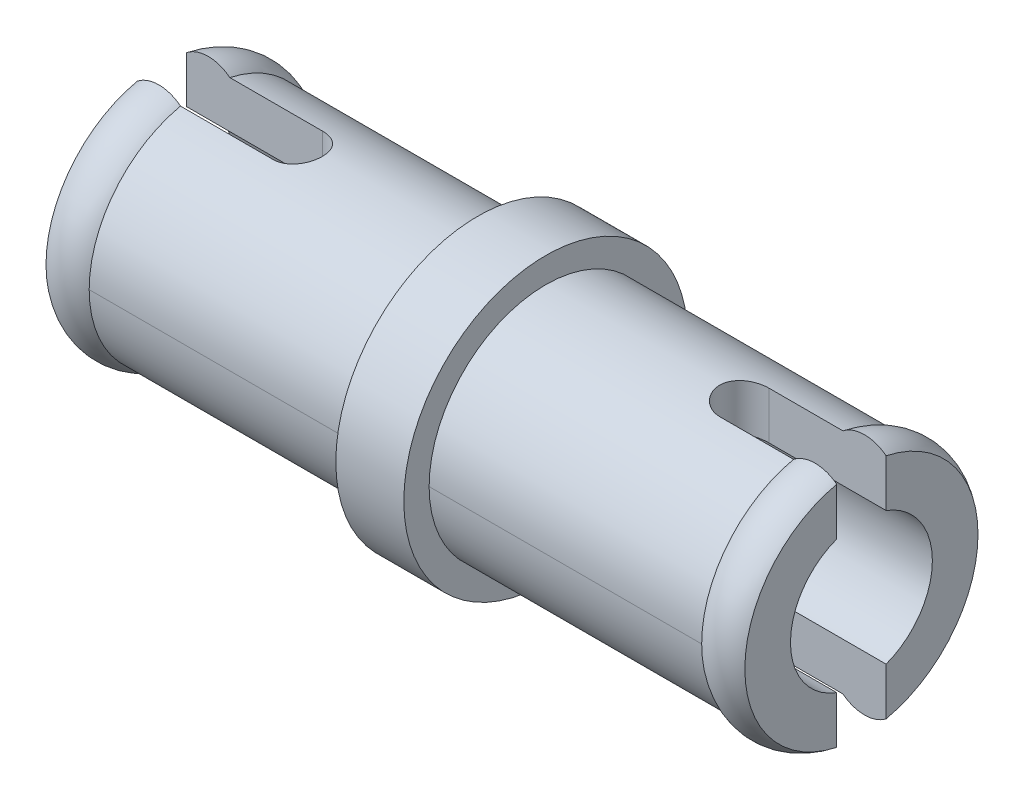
ISO-10303-21;
HEADER;
FILE_DESCRIPTION(('STEP AP214'),'2;1');
FILE_NAME('part.step','',(''),(''),'','','');
FILE_SCHEMA(('AUTOMOTIVE_DESIGN { 1 0 10303 214 1 1 1 1 }'));
ENDSEC;
DATA;
#1=APPLICATION_CONTEXT('core data for automotive mechanical design processes');
#2=APPLICATION_PROTOCOL_DEFINITION('international standard','automotive_design',2000,#1);
#3=PRODUCT_CONTEXT('',#1,'mechanical');
#4=PRODUCT('Part','Part','',(#3));
#5=PRODUCT_RELATED_PRODUCT_CATEGORY('part','',(#4));
#6=PRODUCT_DEFINITION_FORMATION('','',#4);
#7=PRODUCT_DEFINITION_CONTEXT('part definition',#1,'design');
#8=PRODUCT_DEFINITION('design','',#6,#7);
#9=PRODUCT_DEFINITION_SHAPE('','',#8);
#10=(LENGTH_UNIT() NAMED_UNIT(*) SI_UNIT(.MILLI.,.METRE.));
#11=(NAMED_UNIT(*) PLANE_ANGLE_UNIT() SI_UNIT($,.RADIAN.));
#12=(NAMED_UNIT(*) SI_UNIT($,.STERADIAN.) SOLID_ANGLE_UNIT());
#13=UNCERTAINTY_MEASURE_WITH_UNIT(LENGTH_MEASURE(1.E-05),#10,'distance_accuracy_value','');
#14=(GEOMETRIC_REPRESENTATION_CONTEXT(3) GLOBAL_UNCERTAINTY_ASSIGNED_CONTEXT((#13)) GLOBAL_UNIT_ASSIGNED_CONTEXT((#10,
#11,#12)) REPRESENTATION_CONTEXT('',''));
#15=CARTESIAN_POINT('',(0.,0.,0.));
#16=DIRECTION('',(0.,0.,1.));
#17=DIRECTION('',(1.,0.,0.));
#18=AXIS2_PLACEMENT_3D('',#15,#16,#17);
#19=CARTESIAN_POINT('',(6.0555,0.,0.));
#20=DIRECTION('',(-1.,0.,0.));
#21=DIRECTION('',(0.,0.,1.));
#22=AXIS2_PLACEMENT_3D('',#19,#20,#21);
#23=TOROIDAL_SURFACE('',#22,1.81557083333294,0.734259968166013);
#24=CARTESIAN_POINT('',(5.611,0.,0.));
#25=DIRECTION('',(-1.,0.,0.));
#26=DIRECTION('',(0.,0.,1.));
#27=AXIS2_PLACEMENT_3D('',#24,#25,#26);
#28=CIRCLE('',#27,2.4);
#29=CARTESIAN_POINT('',(5.611,-2.34562060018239,0.508000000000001));
#30=VERTEX_POINT('',#29);
#31=CARTESIAN_POINT('',(5.611,0.,2.4));
#32=VERTEX_POINT('',#31);
#33=EDGE_CURVE('E379',#30,#32,#28,.T.);
#34=ORIENTED_EDGE('',*,*,#33,.F.);
#35=CARTESIAN_POINT('',(5.7395089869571,-2.42573626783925,0.508000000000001));
#36=CARTESIAN_POINT('',(5.77593794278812,-2.44347894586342,0.508000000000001));
#37=CARTESIAN_POINT('',(5.81388221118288,-2.45817645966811,0.508000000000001));
#38=CARTESIAN_POINT('',(5.89172986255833,-2.4810084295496,0.508000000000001));
#39=CARTESIAN_POINT('',(5.93163539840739,-2.48913549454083,0.508000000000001));
#40=CARTESIAN_POINT('',(6.01223832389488,-2.49855655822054,0.508000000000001));
#41=CARTESIAN_POINT('',(6.05293549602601,-2.49985240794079,0.508000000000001));
#42=CARTESIAN_POINT('',(6.13395631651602,-2.49557369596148,0.508000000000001));
#43=CARTESIAN_POINT('',(6.17428005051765,-2.49000075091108,0.508000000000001));
#44=CARTESIAN_POINT('',(6.25332847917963,-2.47218033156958,0.508000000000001));
#45=CARTESIAN_POINT('',(6.29205654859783,-2.45994781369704,0.508000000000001));
#46=CARTESIAN_POINT('',(6.36692748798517,-2.42919125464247,0.508000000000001));
#47=CARTESIAN_POINT('',(6.40307024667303,-2.41066694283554,0.508000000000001));
#48=CARTESIAN_POINT('',(6.47198751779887,-2.36775636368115,0.508000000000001));
#49=CARTESIAN_POINT('',(6.50474069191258,-2.34333584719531,0.508000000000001));
#50=CARTESIAN_POINT('',(6.56575985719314,-2.28942037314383,0.508000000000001));
#51=CARTESIAN_POINT('',(6.59402560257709,-2.25992513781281,0.508000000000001));
#52=CARTESIAN_POINT('',(6.64575914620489,-2.19621944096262,0.508000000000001));
#53=CARTESIAN_POINT('',(6.66914486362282,-2.1619423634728,0.508000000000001));
#54=CARTESIAN_POINT('',(6.70999116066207,-2.09002662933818,0.508000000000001));
#55=CARTESIAN_POINT('',(6.72745115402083,-2.05238764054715,0.508000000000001));
#56=CARTESIAN_POINT('',(6.75643899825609,-1.97381192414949,0.508000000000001));
#57=CARTESIAN_POINT('',(6.76780621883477,-1.93281598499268,0.508000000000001));
#58=CARTESIAN_POINT('',(6.78373732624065,-1.84952567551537,0.508000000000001));
#59=CARTESIAN_POINT('',(6.788300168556,-1.80723110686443,0.508000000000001));
#60=CARTESIAN_POINT('',(6.79066159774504,-1.72104793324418,0.508000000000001));
#61=CARTESIAN_POINT('',(6.78823039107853,-1.67715305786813,0.508000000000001));
#62=CARTESIAN_POINT('',(6.77629254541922,-1.59033724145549,0.508000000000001));
#63=CARTESIAN_POINT('',(6.76678459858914,-1.54741648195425,0.508000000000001));
#64=CARTESIAN_POINT('',(6.74057868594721,-1.46219026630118,0.508000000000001));
#65=CARTESIAN_POINT('',(6.72364238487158,-1.41995800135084,0.508000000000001));
#66=CARTESIAN_POINT('',(6.6830419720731,-1.33884980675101,0.508000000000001));
#67=CARTESIAN_POINT('',(6.65937609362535,-1.29997476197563,0.508000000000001));
#68=CARTESIAN_POINT('',(6.60544724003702,-1.22607133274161,0.508000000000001));
#69=CARTESIAN_POINT('',(6.57507905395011,-1.19111948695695,0.508000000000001));
#70=CARTESIAN_POINT('',(6.50869631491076,-1.12703203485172,0.508000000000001));
#71=CARTESIAN_POINT('',(6.47268174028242,-1.09789645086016,0.508000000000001));
#72=CARTESIAN_POINT('',(6.39736426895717,-1.04770937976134,0.508000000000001));
#73=CARTESIAN_POINT('',(6.35824027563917,-1.02639088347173,0.508000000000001));
#74=CARTESIAN_POINT('',(6.27667719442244,-0.991527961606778,0.508000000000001));
#75=CARTESIAN_POINT('',(6.23424203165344,-0.97797448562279,0.508000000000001));
#76=CARTESIAN_POINT('',(6.1521056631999,-0.96057467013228,0.508000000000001));
#77=CARTESIAN_POINT('',(6.11258935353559,-0.955853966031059,0.508000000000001));
#78=CARTESIAN_POINT('',(6.03336667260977,-0.953721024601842,0.508000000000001));
#79=CARTESIAN_POINT('',(5.99366039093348,-0.956305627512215,0.508000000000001));
#80=CARTESIAN_POINT('',(5.91833395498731,-0.968126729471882,0.508000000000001));
#81=CARTESIAN_POINT('',(5.88263102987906,-0.976848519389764,0.508000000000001));
#82=CARTESIAN_POINT('',(5.81308933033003,-0.999898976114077,0.508000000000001));
#83=CARTESIAN_POINT('',(5.77925098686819,-1.01422893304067,0.508000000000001));
#84=CARTESIAN_POINT('',(5.71265405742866,-1.0486415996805,0.508000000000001));
#85=CARTESIAN_POINT('',(5.68001755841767,-1.06895947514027,0.508000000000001));
#86=CARTESIAN_POINT('',(5.61818412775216,-1.11427997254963,0.508000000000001));
#87=CARTESIAN_POINT('',(5.58898849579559,-1.13928435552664,0.508000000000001));
#88=CARTESIAN_POINT('',(5.53161970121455,-1.19613556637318,0.508000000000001));
#89=CARTESIAN_POINT('',(5.50388721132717,-1.22842764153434,0.508000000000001));
#90=CARTESIAN_POINT('',(5.4537869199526,-1.29693809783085,0.508000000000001));
#91=CARTESIAN_POINT('',(5.43142116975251,-1.33315797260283,0.508000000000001));
#92=CARTESIAN_POINT('',(5.39112700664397,-1.41136977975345,0.508000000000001));
#93=CARTESIAN_POINT('',(5.37363973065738,-1.45358993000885,0.508000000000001));
#94=CARTESIAN_POINT('',(5.34591651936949,-1.5403521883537,0.508000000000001));
#95=CARTESIAN_POINT('',(5.33568133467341,-1.58489453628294,0.508000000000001));
#96=CARTESIAN_POINT('',(5.32278397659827,-1.67552516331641,0.508000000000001));
#97=CARTESIAN_POINT('',(5.32019832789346,-1.72162442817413,0.508000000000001));
#98=CARTESIAN_POINT('',(5.32303921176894,-1.81357780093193,0.508000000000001));
#99=CARTESIAN_POINT('',(5.32846442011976,-1.85943194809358,0.508000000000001));
#100=CARTESIAN_POINT('',(5.34704516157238,-1.94819822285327,0.508000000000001));
#101=CARTESIAN_POINT('',(5.35997813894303,-1.99115686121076,0.508000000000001));
#102=CARTESIAN_POINT('',(5.39314850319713,-2.0741725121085,0.508000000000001));
#103=CARTESIAN_POINT('',(5.41338638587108,-2.11422932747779,0.508000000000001));
#104=CARTESIAN_POINT('',(5.45979398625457,-2.18875438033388,0.508000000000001));
#105=CARTESIAN_POINT('',(5.48572497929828,-2.22337150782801,0.508000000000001));
#106=CARTESIAN_POINT('',(5.54317786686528,-2.28755037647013,0.508000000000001));
#107=CARTESIAN_POINT('',(5.57469138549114,-2.31711956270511,0.508000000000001));
#108=CARTESIAN_POINT('',(5.6288267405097,-2.35962712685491,0.508000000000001));
#109=CARTESIAN_POINT('',(5.64996722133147,-2.3744885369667,0.508000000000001));
#110=CARTESIAN_POINT('',(5.69370309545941,-2.40189076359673,0.508000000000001));
#111=CARTESIAN_POINT('',(5.71629846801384,-2.41443161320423,0.508000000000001));
#112=CARTESIAN_POINT('',(5.7395089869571,-2.42573626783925,0.508000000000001));
#113=B_SPLINE_CURVE_WITH_KNOTS('',3,(#35,#36,#37,#38,#39,#40,#41,#42,#43,#44,#45,#46,#47,#48,
#49,#50,#51,#52,#53,#54,#55,#56,#57,#58,#59,#60,#61,#62,#63,#64,#65,#66,#67,#68,#69,#70,#71,#72,
#73,#74,#75,#76,#77,#78,#79,#80,#81,#82,#83,#84,#85,#86,#87,#88,#89,#90,#91,#92,#93,#94,#95,#96,
#97,#98,#99,#100,#101,#102,#103,#104,#105,#106,#107,#108,#109,#110,#111,#112),.UNSPECIFIED.,.T.,
.F.,(4,2,2,2,2,2,2,2,2,2,2,2,2,2,2,2,2,2,2,2,2,2,2,2,2,2,2,2,2,2,2,2,2,2,2,2,2,2,4),(0.,
0.121466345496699,0.243069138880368,0.364638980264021,0.486180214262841,0.607449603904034,
0.728724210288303,0.850720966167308,0.972724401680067,1.09663869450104,1.22056524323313,
1.34761569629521,1.4746856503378,1.60597775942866,1.737294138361,1.87317302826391,
2.00908762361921,2.14731041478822,2.28553373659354,2.41846010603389,2.55123122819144,
2.66997336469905,2.78866414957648,2.89843157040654,3.00822425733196,3.1230887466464,
3.23799648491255,3.36515197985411,3.49235599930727,3.62881325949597,3.76528464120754,
3.90311671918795,4.04092601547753,4.17484486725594,4.30877280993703,4.43789838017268,
4.56683182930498,4.6442245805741,4.72161622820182),.UNSPECIFIED.);
#114=CARTESIAN_POINT('',(6.5,-2.34562060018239,0.508000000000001));
#115=VERTEX_POINT('',#114);
#116=EDGE_CURVE('E231',#30,#115,#113,.T.);
#117=ORIENTED_EDGE('',*,*,#116,.T.);
#118=CARTESIAN_POINT('',(6.5,0.,0.));
#119=DIRECTION('',(1.,0.,0.));
#120=DIRECTION('',(0.,0.,-1.));
#121=AXIS2_PLACEMENT_3D('',#118,#119,#120);
#122=CIRCLE('',#121,2.4);
#123=CARTESIAN_POINT('',(6.5,2.34562060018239,0.508000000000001));
#124=VERTEX_POINT('',#123);
#125=EDGE_CURVE('E430',#124,#115,#122,.T.);
#126=ORIENTED_EDGE('',*,*,#125,.F.);
#127=CARTESIAN_POINT('',(5.84466616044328,0.989441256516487,0.508000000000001));
#128=CARTESIAN_POINT('',(5.87974522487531,0.977622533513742,0.508000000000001));
#129=CARTESIAN_POINT('',(5.91580130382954,0.96865492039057,0.508000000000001));
#130=CARTESIAN_POINT('',(5.98892037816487,0.956926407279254,0.508000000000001));
#131=CARTESIAN_POINT('',(6.0259834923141,0.954166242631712,0.508000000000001));
#132=CARTESIAN_POINT('',(6.10004604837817,0.955024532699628,0.508000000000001));
#133=CARTESIAN_POINT('',(6.13704547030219,0.958644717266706,0.508000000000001));
#134=CARTESIAN_POINT('',(6.20990654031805,0.972045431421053,0.508000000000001));
#135=CARTESIAN_POINT('',(6.24576795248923,0.981827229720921,0.508000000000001));
#136=CARTESIAN_POINT('',(6.31552308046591,1.00705399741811,0.508000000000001));
#137=CARTESIAN_POINT('',(6.34941172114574,1.02251288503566,0.508000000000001));
#138=CARTESIAN_POINT('',(6.41442702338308,1.0584174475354,0.508000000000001));
#139=CARTESIAN_POINT('',(6.44555280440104,1.07886470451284,0.508000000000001));
#140=CARTESIAN_POINT('',(6.50729320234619,1.1261994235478,0.508000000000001));
#141=CARTESIAN_POINT('',(6.53758079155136,1.15351319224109,0.508000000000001));
#142=CARTESIAN_POINT('',(6.59363964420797,1.21243712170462,0.508000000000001));
#143=CARTESIAN_POINT('',(6.61940900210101,1.24404908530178,0.508000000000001));
#144=CARTESIAN_POINT('',(6.66815979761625,1.31392934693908,0.508000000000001));
#145=CARTESIAN_POINT('',(6.69064552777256,1.35254455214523,0.508000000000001));
#146=CARTESIAN_POINT('',(6.7290771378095,1.43290724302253,0.508000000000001));
#147=CARTESIAN_POINT('',(6.74502151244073,1.47465544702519,0.508000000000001));
#148=CARTESIAN_POINT('',(6.77034510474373,1.56170226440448,0.508000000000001));
#149=CARTESIAN_POINT('',(6.77947418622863,1.60707406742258,0.508000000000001));
#150=CARTESIAN_POINT('',(6.78984998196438,1.69871475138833,0.508000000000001));
#151=CARTESIAN_POINT('',(6.79109708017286,1.74498358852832,0.508000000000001));
#152=CARTESIAN_POINT('',(6.78557268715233,1.83627986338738,0.508000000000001));
#153=CARTESIAN_POINT('',(6.77893309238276,1.8813151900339,0.508000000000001));
#154=CARTESIAN_POINT('',(6.75790205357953,1.96954131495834,0.508000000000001));
#155=CARTESIAN_POINT('',(6.74351205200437,2.01273245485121,0.508000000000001));
#156=CARTESIAN_POINT('',(6.70793891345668,2.09439568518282,0.508000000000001));
#157=CARTESIAN_POINT('',(6.68701574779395,2.1329810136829,0.508000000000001));
#158=CARTESIAN_POINT('',(6.63877342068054,2.20592361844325,0.508000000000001));
#159=CARTESIAN_POINT('',(6.61145550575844,2.2402817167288,0.508000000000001));
#160=CARTESIAN_POINT('',(6.55220411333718,2.3025767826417,0.508000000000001));
#161=CARTESIAN_POINT('',(6.52045667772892,2.33069078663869,0.508000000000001));
#162=CARTESIAN_POINT('',(6.45259204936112,2.38102872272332,0.508000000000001));
#163=CARTESIAN_POINT('',(6.41647550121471,2.40325352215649,0.508000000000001));
#164=CARTESIAN_POINT('',(6.34185482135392,2.44063091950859,0.508000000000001));
#165=CARTESIAN_POINT('',(6.30343041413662,2.45594279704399,0.508000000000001));
#166=CARTESIAN_POINT('',(6.22453454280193,2.47979476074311,0.508000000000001));
#167=CARTESIAN_POINT('',(6.18406326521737,2.48833546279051,0.508000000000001));
#168=CARTESIAN_POINT('',(6.10283069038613,2.49830447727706,0.508000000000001));
#169=CARTESIAN_POINT('',(6.06208136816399,2.49983060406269,0.508000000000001));
#170=CARTESIAN_POINT('',(5.98090986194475,2.49599011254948,0.508000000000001));
#171=CARTESIAN_POINT('',(5.94048766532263,2.49062376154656,0.508000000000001));
#172=CARTESIAN_POINT('',(5.861280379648,2.47319948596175,0.508000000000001));
#173=CARTESIAN_POINT('',(5.82248949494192,2.46116787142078,0.508000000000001));
#174=CARTESIAN_POINT('',(5.74746183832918,2.43079929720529,0.508000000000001));
#175=CARTESIAN_POINT('',(5.71122509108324,2.41246227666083,0.508000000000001));
#176=CARTESIAN_POINT('',(5.64209492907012,2.36991080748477,0.508000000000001));
#177=CARTESIAN_POINT('',(5.60922220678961,2.34566276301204,0.508000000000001));
#178=CARTESIAN_POINT('',(5.54793783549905,2.29206936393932,0.508000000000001));
#179=CARTESIAN_POINT('',(5.51952642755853,2.26272373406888,0.508000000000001));
#180=CARTESIAN_POINT('',(5.4674817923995,2.19929747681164,0.508000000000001));
#181=CARTESIAN_POINT('',(5.44392951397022,2.16515046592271,0.508000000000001));
#182=CARTESIAN_POINT('',(5.40273188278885,2.09346528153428,0.508000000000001));
#183=CARTESIAN_POINT('',(5.38508713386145,2.05592676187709,0.508000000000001));
#184=CARTESIAN_POINT('',(5.35571460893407,1.97752824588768,0.508000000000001));
#185=CARTESIAN_POINT('',(5.3441462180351,1.93660858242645,0.508000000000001));
#186=CARTESIAN_POINT('',(5.32780377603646,1.8534370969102,0.508000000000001));
#187=CARTESIAN_POINT('',(5.32303076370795,1.81118507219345,0.508000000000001));
#188=CARTESIAN_POINT('',(5.32023861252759,1.72505699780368,0.508000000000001));
#189=CARTESIAN_POINT('',(5.32244862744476,1.68117354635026,0.508000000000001));
#190=CARTESIAN_POINT('',(5.33394468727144,1.59434626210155,0.508000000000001));
#191=CARTESIAN_POINT('',(5.34323176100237,1.55140256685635,0.508000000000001));
#192=CARTESIAN_POINT('',(5.3689922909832,1.46609532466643,0.508000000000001));
#193=CARTESIAN_POINT('',(5.38570395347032,1.42380362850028,0.508000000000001));
#194=CARTESIAN_POINT('',(5.42587000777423,1.34252667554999,0.508000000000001));
#195=CARTESIAN_POINT('',(5.44932796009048,1.30354317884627,0.508000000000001));
#196=CARTESIAN_POINT('',(5.5028776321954,1.22934563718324,0.508000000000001));
#197=CARTESIAN_POINT('',(5.53308148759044,1.19421236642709,0.508000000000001));
#198=CARTESIAN_POINT('',(5.59913717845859,1.12976845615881,0.508000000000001));
#199=CARTESIAN_POINT('',(5.63498140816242,1.10045009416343,0.508000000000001));
#200=CARTESIAN_POINT('',(5.69973695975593,1.05676584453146,0.508000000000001));
#201=CARTESIAN_POINT('',(5.72742530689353,1.04056740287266,0.508000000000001));
#202=CARTESIAN_POINT('',(5.78472130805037,1.01201636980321,0.508000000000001));
#203=CARTESIAN_POINT('',(5.81432835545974,0.99966256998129,0.508000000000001));
#204=CARTESIAN_POINT('',(5.84466616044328,0.989441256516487,0.508000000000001));
#205=B_SPLINE_CURVE_WITH_KNOTS('',3,(#127,#128,#129,#130,#131,#132,#133,#134,#135,#136,#137,
#138,#139,#140,#141,#142,#143,#144,#145,#146,#147,#148,#149,#150,#151,#152,#153,#154,#155,#156,
#157,#158,#159,#160,#161,#162,#163,#164,#165,#166,#167,#168,#169,#170,#171,#172,#173,#174,#175,
#176,#177,#178,#179,#180,#181,#182,#183,#184,#185,#186,#187,#188,#189,#190,#191,#192,#193,#194,
#195,#196,#197,#198,#199,#200,#201,#202,#203,#204),.UNSPECIFIED.,.T.,.F.,(4,2,2,2,2,2,2,2,2,2,2,
2,2,2,2,2,2,2,2,2,2,2,2,2,2,2,2,2,2,2,2,2,2,2,2,2,2,2,4),(0.,0.110941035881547,
0.221895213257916,0.332879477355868,0.443886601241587,0.555167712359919,0.666484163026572,
0.788333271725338,0.910233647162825,1.0436873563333,1.17717175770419,1.31534242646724,
1.45350636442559,1.58939182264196,1.72525199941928,1.85627731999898,1.98727712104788,
2.11387292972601,2.24045008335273,2.36393981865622,2.48741832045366,2.60916965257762,
2.73091626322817,2.85218568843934,2.97345628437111,3.09543289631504,3.21741609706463,
3.34129135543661,3.46517927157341,3.59217227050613,3.71918468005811,3.85040786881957,
3.98165013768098,4.11744693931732,4.25331554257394,4.39163748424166,4.52977447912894,
4.62575100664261,4.7216973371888),.UNSPECIFIED.);
#206=CARTESIAN_POINT('',(5.61099999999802,2.34562060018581,0.508000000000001));
#207=VERTEX_POINT('',#206);
#208=EDGE_CURVE('E264',#124,#207,#205,.T.);
#209=ORIENTED_EDGE('',*,*,#208,.T.);
#210=EDGE_CURVE('E383',#32,#207,#28,.T.);
#211=ORIENTED_EDGE('',*,*,#210,.F.);
#212=EDGE_LOOP('',(#34,#117,#126,#209,#211));
#213=FACE_BOUND('',#212,.T.);
#214=ADVANCED_FACE('F38',(#213),#23,.T.);
#215=CARTESIAN_POINT('',(6.5,0.,0.));
#216=DIRECTION('',(1.,0.,0.));
#217=DIRECTION('',(0.,0.,-1.));
#218=AXIS2_PLACEMENT_3D('',#215,#216,#217);
#219=PLANE('',#218);
#220=DIRECTION('',(0.,-1.,0.));
#221=VECTOR('',#220,1.);
#222=CARTESIAN_POINT('',(6.5,0.,0.508000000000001));
#223=LINE('',#222,#221);
#224=CARTESIAN_POINT('',(6.5,1.36930502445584,0.508000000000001));
#225=VERTEX_POINT('',#224);
#226=EDGE_CURVE('E51',#124,#225,#223,.T.);
#227=ORIENTED_EDGE('',*,*,#226,.F.);
#228=ORIENTED_EDGE('',*,*,#125,.T.);
#229=CARTESIAN_POINT('',(6.5,-1.36930502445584,0.508000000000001));
#230=VERTEX_POINT('',#229);
#231=EDGE_CURVE('E481',#230,#115,#223,.T.);
#232=ORIENTED_EDGE('',*,*,#231,.F.);
#233=CARTESIAN_POINT('',(6.5,0.,0.));
#234=DIRECTION('',(-1.,0.,0.));
#235=DIRECTION('',(0.,0.,1.));
#236=AXIS2_PLACEMENT_3D('',#233,#234,#235);
#237=CIRCLE('',#236,1.4605);
#238=EDGE_CURVE('E389',#230,#225,#237,.T.);
#239=ORIENTED_EDGE('',*,*,#238,.T.);
#240=EDGE_LOOP('',(#227,#228,#232,#239));
#241=FACE_BOUND('',#240,.T.);
#242=ADVANCED_FACE('F345',(#241),#219,.T.);
#243=CARTESIAN_POINT('',(-7.9,0.,0.));
#244=DIRECTION('',(1.,0.,0.));
#245=DIRECTION('',(0.,0.,-1.));
#246=AXIS2_PLACEMENT_3D('',#243,#244,#245);
#247=CYLINDRICAL_SURFACE('',#246,2.3876);
#248=DIRECTION('',(1.,0.,0.));
#249=VECTOR('',#248,1.);
#250=CARTESIAN_POINT('',(-7.9,-2.33293158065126,-0.507999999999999));
#251=LINE('',#250,#249);
#252=CARTESIAN_POINT('',(-7.010999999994,-2.33293158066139,-0.507999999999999));
#253=VERTEX_POINT('',#252);
#254=CARTESIAN_POINT('',(-5.10600000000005,-2.33293158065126,-0.507999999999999));
#255=VERTEX_POINT('',#254);
#256=EDGE_CURVE('E492',#253,#255,#251,.T.);
#257=ORIENTED_EDGE('',*,*,#256,.F.);
#258=CARTESIAN_POINT('',(-7.01099999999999,0.,0.));
#259=DIRECTION('',(1.,0.,0.));
#260=DIRECTION('',(0.,0.,-1.));
#261=AXIS2_PLACEMENT_3D('',#258,#259,#260);
#262=CIRCLE('',#261,2.3876);
#263=CARTESIAN_POINT('',(-7.01099999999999,0.,-2.3876));
#264=VERTEX_POINT('',#263);
#265=EDGE_CURVE('E393',#253,#264,#262,.T.);
#266=ORIENTED_EDGE('',*,*,#265,.T.);
#267=DIRECTION('',(1.,0.,0.));
#268=VECTOR('',#267,1.);
#269=CARTESIAN_POINT('',(-7.9,0.,-2.3876));
#270=LINE('',#269,#268);
#271=CARTESIAN_POINT('',(-1.4,0.,-2.3876));
#272=VERTEX_POINT('',#271);
#273=EDGE_CURVE('E440',#264,#272,#270,.T.);
#274=ORIENTED_EDGE('',*,*,#273,.T.);
#275=CARTESIAN_POINT('',(-1.4,0.,0.));
#276=DIRECTION('',(-1.,0.,0.));
#277=DIRECTION('',(0.,0.,1.));
#278=AXIS2_PLACEMENT_3D('',#275,#276,#277);
#279=CIRCLE('',#278,2.3876);
#280=CARTESIAN_POINT('',(-1.4,0.,2.3876));
#281=VERTEX_POINT('',#280);
#282=EDGE_CURVE('E404',#272,#281,#279,.T.);
#283=ORIENTED_EDGE('',*,*,#282,.T.);
#284=DIRECTION('',(-1.,0.,0.));
#285=VECTOR('',#284,1.);
#286=CARTESIAN_POINT('',(-7.9,0.,2.3876));
#287=LINE('',#286,#285);
#288=CARTESIAN_POINT('',(-7.01100000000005,0.,2.3876));
#289=VERTEX_POINT('',#288);
#290=EDGE_CURVE('E437',#281,#289,#287,.T.);
#291=ORIENTED_EDGE('',*,*,#290,.T.);
#292=CARTESIAN_POINT('',(-7.0109999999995,-2.33293158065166,0.508000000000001));
#293=VERTEX_POINT('',#292);
#294=EDGE_CURVE('E395',#289,#293,#262,.T.);
#295=ORIENTED_EDGE('',*,*,#294,.T.);
#296=DIRECTION('',(1.,0.,0.));
#297=VECTOR('',#296,1.);
#298=CARTESIAN_POINT('',(-7.9,-2.33293158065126,0.508000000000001));
#299=LINE('',#298,#297);
#300=CARTESIAN_POINT('',(-5.10600000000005,-2.33293158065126,0.508000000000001));
#301=VERTEX_POINT('',#300);
#302=EDGE_CURVE('E333',#301,#293,#299,.F.);
#303=ORIENTED_EDGE('',*,*,#302,.F.);
#304=CARTESIAN_POINT('',(-5.10600000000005,-2.33293158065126,-0.507999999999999));
#305=CARTESIAN_POINT('',(-5.07776432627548,-2.33291136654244,-0.508025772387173));
#306=CARTESIAN_POINT('',(-5.04954333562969,-2.33344365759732,-0.505647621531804));
#307=CARTESIAN_POINT('',(-4.99395811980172,-2.33546100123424,-0.496282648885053));
#308=CARTESIAN_POINT('',(-4.96659253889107,-2.33694445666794,-0.489303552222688));
#309=CARTESIAN_POINT('',(-4.91344407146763,-2.3407129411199,-0.470934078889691));
#310=CARTESIAN_POINT('',(-4.88766128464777,-2.34299802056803,-0.459543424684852));
#311=CARTESIAN_POINT('',(-4.83836676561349,-2.34810502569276,-0.432693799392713));
#312=CARTESIAN_POINT('',(-4.81485535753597,-2.35092702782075,-0.417234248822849));
#313=CARTESIAN_POINT('',(-4.770403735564,-2.35684134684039,-0.382423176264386));
#314=CARTESIAN_POINT('',(-4.74950486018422,-2.35993693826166,-0.363019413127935));
#315=CARTESIAN_POINT('',(-4.71123091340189,-2.36602084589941,-0.320982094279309));
#316=CARTESIAN_POINT('',(-4.69385639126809,-2.36900914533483,-0.298348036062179));
#317=CARTESIAN_POINT('',(-4.66296285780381,-2.37457737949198,-0.2502155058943));
#318=CARTESIAN_POINT('',(-4.64948375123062,-2.37715297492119,-0.224690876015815));
#319=CARTESIAN_POINT('',(-4.62702224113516,-2.38156829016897,-0.171676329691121));
#320=CARTESIAN_POINT('',(-4.61803912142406,-2.3834081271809,-0.144186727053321));
#321=CARTESIAN_POINT('',(-4.60495412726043,-2.38612155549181,-0.0884542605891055));
#322=CARTESIAN_POINT('',(-4.60078179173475,-2.38700908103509,-0.0602286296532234));
#323=CARTESIAN_POINT('',(-4.59721662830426,-2.38776612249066,-0.00346435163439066));
#324=CARTESIAN_POINT('',(-4.59782339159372,-2.3876357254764,0.0250742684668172));
#325=CARTESIAN_POINT('',(-4.60374658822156,-2.38638227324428,0.0811678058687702));
#326=CARTESIAN_POINT('',(-4.60898697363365,-2.38527524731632,0.108731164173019));
#327=CARTESIAN_POINT('',(-4.62390761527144,-2.38221113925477,0.162577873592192));
#328=CARTESIAN_POINT('',(-4.63358803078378,-2.38025402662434,0.188861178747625));
#329=CARTESIAN_POINT('',(-4.65718239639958,-2.37568362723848,0.239615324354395));
#330=CARTESIAN_POINT('',(-4.67112555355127,-2.3730658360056,0.26407216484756));
#331=CARTESIAN_POINT('',(-4.70282751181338,-2.36746174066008,0.310326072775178));
#332=CARTESIAN_POINT('',(-4.72058669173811,-2.36447539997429,0.332122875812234));
#333=CARTESIAN_POINT('',(-4.75982905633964,-2.3583939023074,0.372888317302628));
#334=CARTESIAN_POINT('',(-4.78137837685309,-2.35529775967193,0.391793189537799));
#335=CARTESIAN_POINT('',(-4.827380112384,-2.34939982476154,0.425737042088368));
#336=CARTESIAN_POINT('',(-4.85183332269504,-2.34659811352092,0.440774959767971));
#337=CARTESIAN_POINT('',(-4.90305171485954,-2.34160336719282,0.466584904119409));
#338=CARTESIAN_POINT('',(-4.92982410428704,-2.33941232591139,0.477343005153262));
#339=CARTESIAN_POINT('',(-4.98483722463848,-2.33591539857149,0.494174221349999));
#340=CARTESIAN_POINT('',(-5.0130757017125,-2.33460819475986,0.50025431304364));
#341=CARTESIAN_POINT('',(-5.05228714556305,-2.33352507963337,0.505267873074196));
#342=CARTESIAN_POINT('',(-5.06301220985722,-2.33330278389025,0.506292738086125));
#343=CARTESIAN_POINT('',(-5.08448988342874,-2.33300614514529,0.507657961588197));
#344=CARTESIAN_POINT('',(-5.09524241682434,-2.33293155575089,0.507999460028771));
#345=CARTESIAN_POINT('',(-5.10600000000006,-2.33293158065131,0.508000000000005));
#346=B_SPLINE_CURVE_WITH_KNOTS('',3,(#304,#305,#306,#307,#308,#309,#310,#311,#312,#313,#314,
#315,#316,#317,#318,#319,#320,#321,#322,#323,#324,#325,#326,#327,#328,#329,#330,#331,#332,#333,
#334,#335,#336,#337,#338,#339,#340,#341,#342,#343,#344,#345),.UNSPECIFIED.,.F.,.F.,(4,2,2,2,2,2,
2,2,2,2,2,2,2,2,2,2,2,2,2,2,4),(0.,0.08457969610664,0.169017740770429,0.253461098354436,
0.337916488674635,0.423573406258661,0.509243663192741,0.595762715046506,0.682267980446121,
0.767489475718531,0.852703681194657,0.93654476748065,1.02038886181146,1.1048208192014,
1.18926116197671,1.27535563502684,1.36147374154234,1.44786981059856,1.534136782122,
1.56644773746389,1.59870474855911),.UNSPECIFIED.);
#347=EDGE_CURVE('E332',#255,#301,#346,.T.);
#348=ORIENTED_EDGE('',*,*,#347,.F.);
#349=EDGE_LOOP('',(#257,#266,#274,#283,#291,#295,#303,#348));
#350=FACE_BOUND('',#349,.T.);
#351=ADVANCED_FACE('F339',(#350),#247,.T.);
#352=DIRECTION('',(1.,0.,0.));
#353=VECTOR('',#352,1.);
#354=CARTESIAN_POINT('',(-7.9,2.33293158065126,-0.507999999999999));
#355=LINE('',#354,#353);
#356=CARTESIAN_POINT('',(-5.10600000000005,2.33293158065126,-0.507999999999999));
#357=VERTEX_POINT('',#356);
#358=CARTESIAN_POINT('',(-7.01100000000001,2.33293158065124,-0.507999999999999));
#359=VERTEX_POINT('',#358);
#360=EDGE_CURVE('E495',#357,#359,#355,.F.);
#361=ORIENTED_EDGE('',*,*,#360,.F.);
#362=CARTESIAN_POINT('',(-5.10600000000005,2.33293158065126,0.508000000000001));
#363=CARTESIAN_POINT('',(-5.07776432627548,2.33291136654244,0.508025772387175));
#364=CARTESIAN_POINT('',(-5.04954333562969,2.33344365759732,0.505647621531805));
#365=CARTESIAN_POINT('',(-4.99395811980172,2.33546100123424,0.496282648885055));
#366=CARTESIAN_POINT('',(-4.96659253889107,2.33694445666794,0.48930355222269));
#367=CARTESIAN_POINT('',(-4.91344407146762,2.3407129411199,0.470934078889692));
#368=CARTESIAN_POINT('',(-4.88766128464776,2.34299802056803,0.459543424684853));
#369=CARTESIAN_POINT('',(-4.83836676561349,2.34810502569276,0.432693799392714));
#370=CARTESIAN_POINT('',(-4.81485535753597,2.35092702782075,0.41723424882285));
#371=CARTESIAN_POINT('',(-4.770403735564,2.35684134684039,0.382423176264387));
#372=CARTESIAN_POINT('',(-4.74950486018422,2.35993693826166,0.363019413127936));
#373=CARTESIAN_POINT('',(-4.71123091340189,2.36602084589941,0.320982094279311));
#374=CARTESIAN_POINT('',(-4.69385639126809,2.36900914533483,0.29834803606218));
#375=CARTESIAN_POINT('',(-4.66296285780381,2.37457737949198,0.250215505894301));
#376=CARTESIAN_POINT('',(-4.64948375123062,2.37715297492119,0.224690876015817));
#377=CARTESIAN_POINT('',(-4.62702224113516,2.38156829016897,0.171676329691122));
#378=CARTESIAN_POINT('',(-4.61803912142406,2.3834081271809,0.144186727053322));
#379=CARTESIAN_POINT('',(-4.60495412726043,2.38612155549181,0.0884542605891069));
#380=CARTESIAN_POINT('',(-4.60078179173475,2.38700908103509,0.0602286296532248));
#381=CARTESIAN_POINT('',(-4.59721662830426,2.38776612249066,0.00346435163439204));
#382=CARTESIAN_POINT('',(-4.59782339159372,2.3876357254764,-0.0250742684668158));
#383=CARTESIAN_POINT('',(-4.60374658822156,2.38638227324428,-0.0811678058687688));
#384=CARTESIAN_POINT('',(-4.60898697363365,2.38527524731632,-0.108731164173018));
#385=CARTESIAN_POINT('',(-4.62390761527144,2.38221113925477,-0.162577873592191));
#386=CARTESIAN_POINT('',(-4.63358803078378,2.38025402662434,-0.188861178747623));
#387=CARTESIAN_POINT('',(-4.65718239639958,2.37568362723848,-0.239615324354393));
#388=CARTESIAN_POINT('',(-4.67112555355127,2.3730658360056,-0.264072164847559));
#389=CARTESIAN_POINT('',(-4.70282751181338,2.36746174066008,-0.310326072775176));
#390=CARTESIAN_POINT('',(-4.72058669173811,2.36447539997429,-0.332122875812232));
#391=CARTESIAN_POINT('',(-4.75982905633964,2.3583939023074,-0.372888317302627));
#392=CARTESIAN_POINT('',(-4.78137837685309,2.35529775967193,-0.391793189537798));
#393=CARTESIAN_POINT('',(-4.827380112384,2.34939982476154,-0.425737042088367));
#394=CARTESIAN_POINT('',(-4.85183332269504,2.34659811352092,-0.44077495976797));
#395=CARTESIAN_POINT('',(-4.90305171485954,2.34160336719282,-0.466584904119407));
#396=CARTESIAN_POINT('',(-4.92982410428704,2.33941232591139,-0.477343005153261));
#397=CARTESIAN_POINT('',(-4.98483722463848,2.33591539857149,-0.494174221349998));
#398=CARTESIAN_POINT('',(-5.0130757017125,2.33460819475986,-0.500254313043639));
#399=CARTESIAN_POINT('',(-5.05228714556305,2.33352507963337,-0.505267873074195));
#400=CARTESIAN_POINT('',(-5.06301220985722,2.33330278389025,-0.506292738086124));
#401=CARTESIAN_POINT('',(-5.08448988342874,2.33300614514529,-0.507657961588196));
#402=CARTESIAN_POINT('',(-5.09524241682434,2.33293155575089,-0.50799946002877));
#403=CARTESIAN_POINT('',(-5.10600000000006,2.33293158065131,-0.508000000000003));
#404=B_SPLINE_CURVE_WITH_KNOTS('',3,(#362,#363,#364,#365,#366,#367,#368,#369,#370,#371,#372,
#373,#374,#375,#376,#377,#378,#379,#380,#381,#382,#383,#384,#385,#386,#387,#388,#389,#390,#391,
#392,#393,#394,#395,#396,#397,#398,#399,#400,#401,#402,#403),.UNSPECIFIED.,.F.,.F.,(4,2,2,2,2,2,
2,2,2,2,2,2,2,2,2,2,2,2,2,2,4),(0.,0.08457969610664,0.169017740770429,0.253461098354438,
0.337916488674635,0.423573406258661,0.509243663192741,0.595762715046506,0.682267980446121,
0.767489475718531,0.852703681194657,0.93654476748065,1.02038886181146,1.1048208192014,
1.18926116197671,1.27535563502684,1.36147374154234,1.44786981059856,1.534136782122,
1.56644773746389,1.59870474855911),.UNSPECIFIED.);
#405=CARTESIAN_POINT('',(-5.10600000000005,2.33293158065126,0.508000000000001));
#406=VERTEX_POINT('',#405);
#407=EDGE_CURVE('E326',#406,#357,#404,.T.);
#408=ORIENTED_EDGE('',*,*,#407,.F.);
#409=DIRECTION('',(1.,0.,0.));
#410=VECTOR('',#409,1.);
#411=CARTESIAN_POINT('',(-7.9,2.33293158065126,0.508000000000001));
#412=LINE('',#411,#410);
#413=CARTESIAN_POINT('',(-7.01099999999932,2.33293158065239,0.508000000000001));
#414=VERTEX_POINT('',#413);
#415=EDGE_CURVE('E539',#414,#406,#412,.T.);
#416=ORIENTED_EDGE('',*,*,#415,.F.);
#417=EDGE_CURVE('E396',#414,#289,#262,.T.);
#418=ORIENTED_EDGE('',*,*,#417,.T.);
#419=ORIENTED_EDGE('',*,*,#290,.F.);
#420=EDGE_CURVE('E408',#281,#272,#279,.T.);
#421=ORIENTED_EDGE('',*,*,#420,.T.);
#422=ORIENTED_EDGE('',*,*,#273,.F.);
#423=EDGE_CURVE('E397',#264,#359,#262,.T.);
#424=ORIENTED_EDGE('',*,*,#423,.T.);
#425=EDGE_LOOP('',(#361,#408,#416,#418,#419,#421,#422,#424));
#426=FACE_BOUND('',#425,.T.);
#427=ADVANCED_FACE('F344',(#426),#247,.T.);
#428=CARTESIAN_POINT('',(-7.45550000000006,0.,0.));
#429=DIRECTION('',(1.,0.,0.));
#430=DIRECTION('',(0.,0.,-1.));
#431=AXIS2_PLACEMENT_3D('',#428,#429,#430);
#432=TOROIDAL_SURFACE('',#431,1.81557083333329,0.724429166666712);
#433=CARTESIAN_POINT('',(-7.77186237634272,-2.41440670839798,-0.507999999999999));
#434=CARTESIAN_POINT('',(-7.7360487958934,-2.43217082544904,-0.507999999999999));
#435=CARTESIAN_POINT('',(-7.69871900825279,-2.44694207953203,-0.507999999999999));
#436=CARTESIAN_POINT('',(-7.62207995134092,-2.47002405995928,-0.507999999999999));
#437=CARTESIAN_POINT('',(-7.58276851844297,-2.4783275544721,-0.507999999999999));
#438=CARTESIAN_POINT('',(-7.5033149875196,-2.48819852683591,-0.507999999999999));
#439=CARTESIAN_POINT('',(-7.46317310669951,-2.48976774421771,-0.507999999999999));
#440=CARTESIAN_POINT('',(-7.38320884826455,-2.48612399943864,-0.507999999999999));
#441=CARTESIAN_POINT('',(-7.34338639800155,-2.48091262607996,-0.507999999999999));
#442=CARTESIAN_POINT('',(-7.26527901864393,-2.46389325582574,-0.507999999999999));
#443=CARTESIAN_POINT('',(-7.22699061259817,-2.45210120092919,-0.507999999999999));
#444=CARTESIAN_POINT('',(-7.15291978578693,-2.42229185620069,-0.507999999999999));
#445=CARTESIAN_POINT('',(-7.11713747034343,-2.40427430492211,-0.507999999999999));
#446=CARTESIAN_POINT('',(-7.04885953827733,-2.36243512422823,-0.507999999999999));
#447=CARTESIAN_POINT('',(-7.01638423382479,-2.33858036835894,-0.507999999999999));
#448=CARTESIAN_POINT('',(-6.95582380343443,-2.28583420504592,-0.507999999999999));
#449=CARTESIAN_POINT('',(-6.92773891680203,-2.25694252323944,-0.507999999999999));
#450=CARTESIAN_POINT('',(-6.87627017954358,-2.19447661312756,-0.507999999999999));
#451=CARTESIAN_POINT('',(-6.85296649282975,-2.16083637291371,-0.507999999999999));
#452=CARTESIAN_POINT('',(-6.8121792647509,-2.09019893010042,-0.507999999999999));
#453=CARTESIAN_POINT('',(-6.79469629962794,-2.05320139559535,-0.507999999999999));
#454=CARTESIAN_POINT('',(-6.76555906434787,-1.97591438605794,-0.507999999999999));
#455=CARTESIAN_POINT('',(-6.75406246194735,-1.93556551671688,-0.507999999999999));
#456=CARTESIAN_POINT('',(-6.73777030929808,-1.85353960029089,-0.507999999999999));
#457=CARTESIAN_POINT('',(-6.7329757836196,-1.81186235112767,-0.507999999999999));
#458=CARTESIAN_POINT('',(-6.7300483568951,-1.72689500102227,-0.507999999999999));
#459=CARTESIAN_POINT('',(-6.73214105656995,-1.68359715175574,-0.507999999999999));
#460=CARTESIAN_POINT('',(-6.74331186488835,-1.59791307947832,-0.507999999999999));
#461=CARTESIAN_POINT('',(-6.75239126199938,-1.55552702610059,-0.507999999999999));
#462=CARTESIAN_POINT('',(-6.77764314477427,-1.47132600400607,-0.507999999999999));
#463=CARTESIAN_POINT('',(-6.79404913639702,-1.4295809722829,-0.507999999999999));
#464=CARTESIAN_POINT('',(-6.83351717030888,-1.34935461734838,-0.507999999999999));
#465=CARTESIAN_POINT('',(-6.85658090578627,-1.31087412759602,-0.507999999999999));
#466=CARTESIAN_POINT('',(-6.90923204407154,-1.23766705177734,-0.507999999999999));
#467=CARTESIAN_POINT('',(-6.93892248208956,-1.2030143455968,-0.507999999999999));
#468=CARTESIAN_POINT('',(-7.00390167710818,-1.13939625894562,-0.507999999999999));
#469=CARTESIAN_POINT('',(-7.03919046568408,-1.11043091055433,-0.507999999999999));
#470=CARTESIAN_POINT('',(-7.113094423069,-1.06039859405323,-0.507999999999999));
#471=CARTESIAN_POINT('',(-7.15153667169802,-1.03907755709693,-0.507999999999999));
#472=CARTESIAN_POINT('',(-7.23174181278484,-1.00405562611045,-0.507999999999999));
#473=CARTESIAN_POINT('',(-7.27350093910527,-0.990346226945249,-0.507999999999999));
#474=CARTESIAN_POINT('',(-7.35450535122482,-0.972470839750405,-0.507999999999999));
#475=CARTESIAN_POINT('',(-7.39356591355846,-0.967466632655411,-0.507999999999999));
#476=CARTESIAN_POINT('',(-7.47193657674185,-0.964688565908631,-0.507999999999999));
#477=CARTESIAN_POINT('',(-7.51124655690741,-0.966911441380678,-0.507999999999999));
#478=CARTESIAN_POINT('',(-7.58587133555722,-0.977986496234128,-0.507999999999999));
#479=CARTESIAN_POINT('',(-7.62126403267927,-0.986326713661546,-0.507999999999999));
#480=CARTESIAN_POINT('',(-7.69024171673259,-1.00859073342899,-0.507999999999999));
#481=CARTESIAN_POINT('',(-7.72382630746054,-1.02251575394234,-0.507999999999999));
#482=CARTESIAN_POINT('',(-7.78983097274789,-1.05602866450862,-0.507999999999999));
#483=CARTESIAN_POINT('',(-7.8221413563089,-1.07583155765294,-0.507999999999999));
#484=CARTESIAN_POINT('',(-7.8833948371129,-1.12008951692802,-0.507999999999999));
#485=CARTESIAN_POINT('',(-7.91233668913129,-1.14454629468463,-0.507999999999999));
#486=CARTESIAN_POINT('',(-7.96918096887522,-1.20015504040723,-0.507999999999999));
#487=CARTESIAN_POINT('',(-7.99666124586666,-1.23173901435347,-0.507999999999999));
#488=CARTESIAN_POINT('',(-8.04637419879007,-1.29879993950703,-0.507999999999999));
#489=CARTESIAN_POINT('',(-8.06860486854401,-1.33427837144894,-0.507999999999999));
#490=CARTESIAN_POINT('',(-8.10876410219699,-1.41096304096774,-0.507999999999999));
#491=CARTESIAN_POINT('',(-8.12625653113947,-1.45239859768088,-0.507999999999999));
#492=CARTESIAN_POINT('',(-8.15413557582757,-1.53759963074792,-0.507999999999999));
#493=CARTESIAN_POINT('',(-8.16452138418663,-1.58136537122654,-0.507999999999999));
#494=CARTESIAN_POINT('',(-8.17788552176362,-1.67055797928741,-0.507999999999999));
#495=CARTESIAN_POINT('',(-8.1807738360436,-1.71599844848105,-0.507999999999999));
#496=CARTESIAN_POINT('',(-8.1786582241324,-1.80669767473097,-0.507999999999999));
#497=CARTESIAN_POINT('',(-8.17365553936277,-1.85195645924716,-0.507999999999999));
#498=CARTESIAN_POINT('',(-8.15600540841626,-1.93968909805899,-0.507999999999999));
#499=CARTESIAN_POINT('',(-8.14356812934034,-1.98220515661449,-0.507999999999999));
#500=CARTESIAN_POINT('',(-8.11146056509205,-2.06442961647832,-0.507999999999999));
#501=CARTESIAN_POINT('',(-8.09178977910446,-2.1041378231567,-0.507999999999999));
#502=CARTESIAN_POINT('',(-8.04654365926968,-2.17809054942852,-0.507999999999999));
#503=CARTESIAN_POINT('',(-8.02120385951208,-2.21247939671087,-0.507999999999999));
#504=CARTESIAN_POINT('',(-7.96496178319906,-2.27630635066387,-0.507999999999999));
#505=CARTESIAN_POINT('',(-7.93406782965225,-2.30575173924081,-0.507999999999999));
#506=CARTESIAN_POINT('',(-7.88089265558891,-2.34817751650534,-0.507999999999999));
#507=CARTESIAN_POINT('',(-7.86008680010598,-2.36304255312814,-0.507999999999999));
#508=CARTESIAN_POINT('',(-7.81701445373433,-2.39048131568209,-0.507999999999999));
#509=CARTESIAN_POINT('',(-7.79474798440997,-2.40305507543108,-0.507999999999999));
#510=CARTESIAN_POINT('',(-7.77186237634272,-2.41440670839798,-0.507999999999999));
#511=B_SPLINE_CURVE_WITH_KNOTS('',3,(#433,#434,#435,#436,#437,#438,#439,#440,#441,#442,#443,
#444,#445,#446,#447,#448,#449,#450,#451,#452,#453,#454,#455,#456,#457,#458,#459,#460,#461,#462,
#463,#464,#465,#466,#467,#468,#469,#470,#471,#472,#473,#474,#475,#476,#477,#478,#479,#480,#481,
#482,#483,#484,#485,#486,#487,#488,#489,#490,#491,#492,#493,#494,#495,#496,#497,#498,#499,#500,
#501,#502,#503,#504,#505,#506,#507,#508,#509,#510),.UNSPECIFIED.,.T.,.F.,(4,2,2,2,2,2,2,2,2,2,2,
2,2,2,2,2,2,2,2,2,2,2,2,2,2,2,2,2,2,2,2,2,2,2,2,2,2,2,4),(0.,0.119838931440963,
0.239811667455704,0.359753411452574,0.479667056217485,0.599291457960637,0.718920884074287,
0.839245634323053,0.959576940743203,1.08178526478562,1.20400568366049,1.3293002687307,
1.45461400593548,1.58407289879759,1.71355567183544,1.84749761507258,1.98147365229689,
2.11769925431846,2.25392562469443,2.38507648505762,2.51608050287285,2.63357763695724,
2.75102169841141,2.85961933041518,2.96824066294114,3.08146587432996,3.19473280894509,
3.31979578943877,3.44490648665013,3.57921008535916,3.71352893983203,3.8494531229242,
3.98535592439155,4.11758743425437,4.24982810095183,4.37735371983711,4.50468980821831,
4.58127045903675,4.65784997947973),.UNSPECIFIED.);
#512=CARTESIAN_POINT('',(-7.90000000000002,-2.33293158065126,-0.507999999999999));
#513=VERTEX_POINT('',#512);
#514=EDGE_CURVE('E494',#513,#253,#511,.T.);
#515=ORIENTED_EDGE('',*,*,#514,.F.);
#516=CARTESIAN_POINT('',(-7.9,0.,0.));
#517=DIRECTION('',(-1.,0.,0.));
#518=DIRECTION('',(0.,0.,1.));
#519=AXIS2_PLACEMENT_3D('',#516,#517,#518);
#520=CIRCLE('',#519,2.3876);
#521=CARTESIAN_POINT('',(-7.90000000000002,2.33293158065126,-0.507999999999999));
#522=VERTEX_POINT('',#521);
#523=EDGE_CURVE('E423',#522,#513,#520,.T.);
#524=ORIENTED_EDGE('',*,*,#523,.F.);
#525=CARTESIAN_POINT('',(-7.6617089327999,0.999411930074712,-0.507999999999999));
#526=CARTESIAN_POINT('',(-7.62699167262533,0.987849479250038,-0.507999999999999));
#527=CARTESIAN_POINT('',(-7.59131634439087,0.979113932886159,-0.507999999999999));
#528=CARTESIAN_POINT('',(-7.51899193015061,0.967784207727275,-0.507999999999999));
#529=CARTESIAN_POINT('',(-7.48234269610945,0.965190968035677,-0.507999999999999));
#530=CARTESIAN_POINT('',(-7.40913264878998,0.966305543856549,-0.507999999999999));
#531=CARTESIAN_POINT('',(-7.37257185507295,0.970014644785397,-0.507999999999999));
#532=CARTESIAN_POINT('',(-7.30059553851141,0.983513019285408,-0.507999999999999));
#533=CARTESIAN_POINT('',(-7.26518024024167,0.99330347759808,-0.507999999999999));
#534=CARTESIAN_POINT('',(-7.19628839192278,1.01848422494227,-0.507999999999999));
#535=CARTESIAN_POINT('',(-7.16281838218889,1.03389226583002,-0.507999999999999));
#536=CARTESIAN_POINT('',(-7.09863277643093,1.06963993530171,-0.507999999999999));
#537=CARTESIAN_POINT('',(-7.06791804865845,1.0899811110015,-0.507999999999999));
#538=CARTESIAN_POINT('',(-7.00707813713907,1.13700487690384,-0.507999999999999));
#539=CARTESIAN_POINT('',(-6.97727277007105,1.16410101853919,-0.507999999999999));
#540=CARTESIAN_POINT('',(-6.9221486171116,1.2225260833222,-0.507999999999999));
#541=CARTESIAN_POINT('',(-6.89683169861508,1.253856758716,-0.507999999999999));
#542=CARTESIAN_POINT('',(-6.84903486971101,1.32302449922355,-0.507999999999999));
#543=CARTESIAN_POINT('',(-6.82703686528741,1.3611955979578,-0.507999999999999));
#544=CARTESIAN_POINT('',(-6.78950542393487,1.44059799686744,-0.507999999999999));
#545=CARTESIAN_POINT('',(-6.77397345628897,1.48182999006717,-0.507999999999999));
#546=CARTESIAN_POINT('',(-6.74940460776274,1.56774776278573,-0.507999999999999));
#547=CARTESIAN_POINT('',(-6.74061181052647,1.61250374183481,-0.507999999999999));
#548=CARTESIAN_POINT('',(-6.73079481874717,1.70286422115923,-0.507999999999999));
#549=CARTESIAN_POINT('',(-6.72977026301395,1.74846868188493,-0.507999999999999));
#550=CARTESIAN_POINT('',(-6.73561402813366,1.83843904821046,-0.507999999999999));
#551=CARTESIAN_POINT('',(-6.742355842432,1.88281308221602,-0.507999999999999));
#552=CARTESIAN_POINT('',(-6.76347150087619,1.96970987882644,-0.507999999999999));
#553=CARTESIAN_POINT('',(-6.77784394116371,2.01223298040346,-0.507999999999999));
#554=CARTESIAN_POINT('',(-6.81326968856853,2.0926137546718,-0.507999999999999));
#555=CARTESIAN_POINT('',(-6.83406978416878,2.13058301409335,-0.507999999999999));
#556=CARTESIAN_POINT('',(-6.88196005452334,2.20232475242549,-0.507999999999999));
#557=CARTESIAN_POINT('',(-6.9090490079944,2.23609804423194,-0.507999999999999));
#558=CARTESIAN_POINT('',(-6.96775465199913,2.29729520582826,-0.507999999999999));
#559=CARTESIAN_POINT('',(-6.99918908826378,2.32489399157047,-0.507999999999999));
#560=CARTESIAN_POINT('',(-7.06634374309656,2.374262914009,-0.507999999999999));
#561=CARTESIAN_POINT('',(-7.1020633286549,2.39603391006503,-0.507999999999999));
#562=CARTESIAN_POINT('',(-7.17582695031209,2.43258885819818,-0.507999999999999));
#563=CARTESIAN_POINT('',(-7.21379292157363,2.44753045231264,-0.507999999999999));
#564=CARTESIAN_POINT('',(-7.29171553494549,2.47072529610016,-0.507999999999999));
#565=CARTESIAN_POINT('',(-7.3316719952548,2.47897915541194,-0.507999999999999));
#566=CARTESIAN_POINT('',(-7.41184061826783,2.48847012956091,-0.507999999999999));
#567=CARTESIAN_POINT('',(-7.45204137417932,2.48980383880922,-0.507999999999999));
#568=CARTESIAN_POINT('',(-7.53209122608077,2.48567432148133,-0.507999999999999));
#569=CARTESIAN_POINT('',(-7.5719403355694,2.48021135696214,-0.507999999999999));
#570=CARTESIAN_POINT('',(-7.64999911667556,2.46269223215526,-0.507999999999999));
#571=CARTESIAN_POINT('',(-7.68821449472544,2.45066146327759,-0.507999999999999));
#572=CARTESIAN_POINT('',(-7.76209994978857,2.42039179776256,-0.507999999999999));
#573=CARTESIAN_POINT('',(-7.7977700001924,2.40215283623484,-0.507999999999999));
#574=CARTESIAN_POINT('',(-7.86579529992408,2.35988870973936,-0.507999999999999));
#575=CARTESIAN_POINT('',(-7.89812934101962,2.33582943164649,-0.507999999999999));
#576=CARTESIAN_POINT('',(-7.95837630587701,2.2827012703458,-0.507999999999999));
#577=CARTESIAN_POINT('',(-7.98628898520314,2.25363211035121,-0.507999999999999));
#578=CARTESIAN_POINT('',(-8.03738974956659,2.1908347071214,-0.507999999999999));
#579=CARTESIAN_POINT('',(-8.06049634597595,2.1570401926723,-0.507999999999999));
#580=CARTESIAN_POINT('',(-8.10086798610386,2.08612890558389,-0.507999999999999));
#581=CARTESIAN_POINT('',(-8.11813242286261,2.04901178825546,-0.507999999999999));
#582=CARTESIAN_POINT('',(-8.14681440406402,1.97151387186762,-0.507999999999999));
#583=CARTESIAN_POINT('',(-8.15807283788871,1.93107423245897,-0.507999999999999));
#584=CARTESIAN_POINT('',(-8.17387789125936,1.84890669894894,-0.507999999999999));
#585=CARTESIAN_POINT('',(-8.17842347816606,1.80717860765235,-0.507999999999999));
#586=CARTESIAN_POINT('',(-8.18084070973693,1.72214345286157,-0.507999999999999));
#587=CARTESIAN_POINT('',(-8.17848571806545,1.6788299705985,-0.507999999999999));
#588=CARTESIAN_POINT('',(-8.16679068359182,1.5931590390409,-0.507999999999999));
#589=CARTESIAN_POINT('',(-8.15744962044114,1.55080173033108,-0.507999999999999));
#590=CARTESIAN_POINT('',(-8.13167465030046,1.46671125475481,-0.507999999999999));
#591=CARTESIAN_POINT('',(-8.11500896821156,1.42504904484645,-0.507999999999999));
#592=CARTESIAN_POINT('',(-8.07502901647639,1.34502032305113,-0.507999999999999));
#593=CARTESIAN_POINT('',(-8.05171126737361,1.30665554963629,-0.507999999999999));
#594=CARTESIAN_POINT('',(-7.99856842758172,1.23373420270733,-0.507999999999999));
#595=CARTESIAN_POINT('',(-7.96864106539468,1.19925201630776,-0.507999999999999));
#596=CARTESIAN_POINT('',(-7.90323972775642,1.13606280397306,-0.507999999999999));
#597=CARTESIAN_POINT('',(-7.86777340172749,1.10734793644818,-0.507999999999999));
#598=CARTESIAN_POINT('',(-7.80390737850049,1.06473851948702,-0.507999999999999));
#599=CARTESIAN_POINT('',(-7.7767190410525,1.04900791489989,-0.507999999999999));
#600=CARTESIAN_POINT('',(-7.72049080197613,1.02129799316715,-0.507999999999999));
#601=CARTESIAN_POINT('',(-7.69145145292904,1.00931756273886,-0.507999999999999));
#602=CARTESIAN_POINT('',(-7.6617089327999,0.999411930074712,-0.507999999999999));
#603=B_SPLINE_CURVE_WITH_KNOTS('',3,(#525,#526,#527,#528,#529,#530,#531,#532,#533,#534,#535,
#536,#537,#538,#539,#540,#541,#542,#543,#544,#545,#546,#547,#548,#549,#550,#551,#552,#553,#554,
#555,#556,#557,#558,#559,#560,#561,#562,#563,#564,#565,#566,#567,#568,#569,#570,#571,#572,#573,
#574,#575,#576,#577,#578,#579,#580,#581,#582,#583,#584,#585,#586,#587,#588,#589,#590,#591,#592,
#593,#594,#595,#596,#597,#598,#599,#600,#601,#602),.UNSPECIFIED.,.T.,.F.,(4,2,2,2,2,2,2,2,2,2,2,
2,2,2,2,2,2,2,2,2,2,2,2,2,2,2,2,2,2,2,2,2,2,2,2,2,2,2,4),(0.,0.109669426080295,
0.219355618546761,0.32906418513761,0.43879413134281,0.548873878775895,0.658988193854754,
0.779331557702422,0.899724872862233,1.03130037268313,1.16290575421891,1.29907788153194,
1.43524367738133,1.56922245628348,1.70317659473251,1.83241142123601,1.96162117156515,
2.08649884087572,2.21135808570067,2.33316824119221,2.45496729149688,2.57506155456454,
2.6951511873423,2.81477980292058,2.93440966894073,3.05475844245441,3.17511386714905,
3.2973681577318,3.41963514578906,3.54499791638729,3.67037996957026,3.799925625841,
3.92949020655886,4.0634884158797,4.19755684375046,4.33386660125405,4.46998975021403,
4.56397224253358,4.65792680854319),.UNSPECIFIED.);
#604=EDGE_CURVE('E497',#359,#522,#603,.T.);
#605=ORIENTED_EDGE('',*,*,#604,.F.);
#606=ORIENTED_EDGE('',*,*,#423,.F.);
#607=ORIENTED_EDGE('',*,*,#265,.F.);
#608=EDGE_LOOP('',(#515,#524,#605,#606,#607));
#609=FACE_BOUND('',#608,.T.);
#610=ADVANCED_FACE('F501',(#609),#432,.T.);
#611=CARTESIAN_POINT('',(-7.77186237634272,-2.41440670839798,0.508000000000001));
#612=CARTESIAN_POINT('',(-7.80841976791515,-2.39626933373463,0.508000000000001));
#613=CARTESIAN_POINT('',(-7.8434543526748,-2.3749841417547,0.508000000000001));
#614=CARTESIAN_POINT('',(-7.90945466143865,-2.32678027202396,0.508000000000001));
#615=CARTESIAN_POINT('',(-7.94041440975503,-2.29985346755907,0.508000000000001));
#616=CARTESIAN_POINT('',(-7.99735309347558,-2.2412414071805,0.508000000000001));
#617=CARTESIAN_POINT('',(-8.02333899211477,-2.20956291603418,0.508000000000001));
#618=CARTESIAN_POINT('',(-8.06971849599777,-2.14236763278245,0.508000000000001));
#619=CARTESIAN_POINT('',(-8.09011355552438,-2.10685184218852,0.508000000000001));
#620=CARTESIAN_POINT('',(-8.12515973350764,-2.03234224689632,0.508000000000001));
#621=CARTESIAN_POINT('',(-8.13970554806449,-1.99329896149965,0.508000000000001));
#622=CARTESIAN_POINT('',(-8.1622572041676,-1.91336830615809,0.508000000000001));
#623=CARTESIAN_POINT('',(-8.17026186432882,-1.87248060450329,0.508000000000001));
#624=CARTESIAN_POINT('',(-8.1797830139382,-1.78865101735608,0.508000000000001));
#625=CARTESIAN_POINT('',(-8.18108687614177,-1.74568501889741,0.508000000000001));
#626=CARTESIAN_POINT('',(-8.17672222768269,-1.66011025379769,0.508000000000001));
#627=CARTESIAN_POINT('',(-8.17105246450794,-1.61750155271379,0.508000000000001));
#628=CARTESIAN_POINT('',(-8.15266935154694,-1.53225792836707,0.508000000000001));
#629=CARTESIAN_POINT('',(-8.13971495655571,-1.48967493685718,0.508000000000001));
#630=CARTESIAN_POINT('',(-8.10701264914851,-1.4071967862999,0.508000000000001));
#631=CARTESIAN_POINT('',(-8.08726322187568,-1.36730222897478,0.508000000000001));
#632=CARTESIAN_POINT('',(-8.04094147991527,-1.2903790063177,0.508000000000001));
#633=CARTESIAN_POINT('',(-8.01421790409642,-1.25344119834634,0.508000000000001));
#634=CARTESIAN_POINT('',(-7.95482939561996,-1.18466671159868,0.508000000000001));
#635=CARTESIAN_POINT('',(-7.92216339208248,-1.15283095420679,0.508000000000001));
#636=CARTESIAN_POINT('',(-7.85238961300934,-1.09607122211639,0.508000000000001));
#637=CARTESIAN_POINT('',(-7.81538712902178,-1.07101844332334,0.508000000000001));
#638=CARTESIAN_POINT('',(-7.73737719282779,-1.02820950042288,0.508000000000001));
#639=CARTESIAN_POINT('',(-7.69637346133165,-1.01044663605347,0.508000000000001));
#640=CARTESIAN_POINT('',(-7.61553393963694,-0.984594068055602,0.508000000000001));
#641=CARTESIAN_POINT('',(-7.57593420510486,-0.975768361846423,0.508000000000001));
#642=CARTESIAN_POINT('',(-7.49579222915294,-0.965678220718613,0.508000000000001));
#643=CARTESIAN_POINT('',(-7.45525071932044,-0.964408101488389,0.508000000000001));
#644=CARTESIAN_POINT('',(-7.37847985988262,-0.969263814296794,0.508000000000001));
#645=CARTESIAN_POINT('',(-7.34220474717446,-0.97470273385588,0.508000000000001));
#646=CARTESIAN_POINT('',(-7.27106165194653,-0.991516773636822,0.508000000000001));
#647=CARTESIAN_POINT('',(-7.23619389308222,-1.00289283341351,0.508000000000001));
#648=CARTESIAN_POINT('',(-7.16824214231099,-1.03120726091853,0.508000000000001));
#649=CARTESIAN_POINT('',(-7.13518967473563,-1.04822073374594,0.508000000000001));
#650=CARTESIAN_POINT('',(-7.07205822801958,-1.08706816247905,0.508000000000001));
#651=CARTESIAN_POINT('',(-7.04198022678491,-1.10890369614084,0.508000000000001));
#652=CARTESIAN_POINT('',(-6.98250552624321,-1.15907308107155,0.508000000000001));
#653=CARTESIAN_POINT('',(-6.95347090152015,-1.18783620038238,0.508000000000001));
#654=CARTESIAN_POINT('',(-6.90016420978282,-1.24948197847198,0.508000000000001));
#655=CARTESIAN_POINT('',(-6.87589410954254,-1.28236632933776,0.508000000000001));
#656=CARTESIAN_POINT('',(-6.83071745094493,-1.35441734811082,0.508000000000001));
#657=CARTESIAN_POINT('',(-6.81028355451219,-1.39388139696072,0.508000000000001));
#658=CARTESIAN_POINT('',(-6.77613180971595,-1.47562020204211,0.508000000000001));
#659=CARTESIAN_POINT('',(-6.76241519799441,-1.51789547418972,0.508000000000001));
#660=CARTESIAN_POINT('',(-6.7418642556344,-1.60525814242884,0.508000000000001));
#661=CARTESIAN_POINT('',(-6.73521799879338,-1.6503900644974,0.508000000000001));
#662=CARTESIAN_POINT('',(-6.72976600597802,-1.74112935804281,0.508000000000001));
#663=CARTESIAN_POINT('',(-6.73095967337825,-1.78673669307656,0.508000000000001));
#664=CARTESIAN_POINT('',(-6.74119056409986,-1.87611481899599,0.508000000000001));
#665=CARTESIAN_POINT('',(-6.75006553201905,-1.9199040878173,0.508000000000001));
#666=CARTESIAN_POINT('',(-6.77531825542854,-2.00526626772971,0.508000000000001));
#667=CARTESIAN_POINT('',(-6.79169458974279,-2.04683959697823,0.508000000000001));
#668=CARTESIAN_POINT('',(-6.83084920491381,-2.12499292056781,0.508000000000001));
#669=CARTESIAN_POINT('',(-6.8533767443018,-2.16169854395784,0.508000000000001));
#670=CARTESIAN_POINT('',(-6.90446929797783,-2.23063728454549,0.508000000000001));
#671=CARTESIAN_POINT('',(-6.93303317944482,-2.26287123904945,0.508000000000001));
#672=CARTESIAN_POINT('',(-6.9943740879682,-2.320851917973,0.508000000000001));
#673=CARTESIAN_POINT('',(-7.02698426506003,-2.34677525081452,0.508000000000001));
#674=CARTESIAN_POINT('',(-7.09617729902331,-2.3926243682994,0.508000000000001));
#675=CARTESIAN_POINT('',(-7.13275942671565,-2.4125512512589,0.508000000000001));
#676=CARTESIAN_POINT('',(-7.20794300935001,-2.44538101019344,0.508000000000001));
#677=CARTESIAN_POINT('',(-7.24647836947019,-2.45843538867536,0.508000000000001));
#678=CARTESIAN_POINT('',(-7.32521997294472,-2.47780014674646,0.508000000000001));
#679=CARTESIAN_POINT('',(-7.36542653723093,-2.48410922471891,0.508000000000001));
#680=CARTESIAN_POINT('',(-7.44583403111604,-2.48974597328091,0.508000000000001));
#681=CARTESIAN_POINT('',(-7.48602921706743,-2.48915666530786,0.508000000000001));
#682=CARTESIAN_POINT('',(-7.56570769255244,-2.48121347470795,0.508000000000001));
#683=CARTESIAN_POINT('',(-7.60519187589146,-2.4738687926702,0.508000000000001));
#684=CARTESIAN_POINT('',(-7.66582662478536,-2.45721164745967,0.508000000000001));
#685=CARTESIAN_POINT('',(-7.68760038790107,-2.45008186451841,0.508000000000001));
#686=CARTESIAN_POINT('',(-7.73036332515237,-2.43376720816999,0.508000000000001));
#687=CARTESIAN_POINT('',(-7.75135250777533,-2.42458235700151,0.508000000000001));
#688=CARTESIAN_POINT('',(-7.77186237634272,-2.41440670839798,0.508000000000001));
#689=B_SPLINE_CURVE_WITH_KNOTS('',3,(#611,#612,#613,#614,#615,#616,#617,#618,#619,#620,#621,
#622,#623,#624,#625,#626,#627,#628,#629,#630,#631,#632,#633,#634,#635,#636,#637,#638,#639,#640,
#641,#642,#643,#644,#645,#646,#647,#648,#649,#650,#651,#652,#653,#654,#655,#656,#657,#658,#659,
#660,#661,#662,#663,#664,#665,#666,#667,#668,#669,#670,#671,#672,#673,#674,#675,#676,#677,#678,
#679,#680,#681,#682,#683,#684,#685,#686,#687,#688),.UNSPECIFIED.,.T.,.F.,(4,2,2,2,2,2,2,2,2,2,2,
2,2,2,2,2,2,2,2,2,2,2,2,2,2,2,2,2,2,2,2,2,2,2,2,2,2,2,4),(0.,0.122342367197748,
0.244862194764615,0.367209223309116,0.489524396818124,0.613952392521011,0.738402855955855,
0.866778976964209,0.995178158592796,1.12809961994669,1.2610507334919,1.39716751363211,
1.53330884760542,1.66664734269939,1.79986300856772,1.92089724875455,2.04184041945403,
2.15136565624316,2.26090823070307,2.37197317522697,2.48307451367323,2.60517205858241,
2.72731989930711,2.86003547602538,2.99277547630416,3.12896430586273,3.26514277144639,
3.39851299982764,3.53185797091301,3.66041927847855,3.78895648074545,3.91332147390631,
4.03766367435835,4.15913599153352,4.28063174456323,4.40066682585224,4.52053866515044,
4.58917739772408,4.65781538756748),.UNSPECIFIED.);
#690=CARTESIAN_POINT('',(-7.90000000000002,-2.33293158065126,0.508000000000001));
#691=VERTEX_POINT('',#690);
#692=EDGE_CURVE('E515',#293,#691,#689,.T.);
#693=ORIENTED_EDGE('',*,*,#692,.F.);
#694=ORIENTED_EDGE('',*,*,#294,.F.);
#695=ORIENTED_EDGE('',*,*,#417,.F.);
#696=CARTESIAN_POINT('',(-7.6617089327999,0.999411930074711,0.508000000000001));
#697=CARTESIAN_POINT('',(-7.70077173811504,1.01242590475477,0.508000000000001));
#698=CARTESIAN_POINT('',(-7.73868364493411,1.02904274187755,0.508000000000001));
#699=CARTESIAN_POINT('',(-7.81113022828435,1.06857026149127,0.508000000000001));
#700=CARTESIAN_POINT('',(-7.84565599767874,1.09149696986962,0.508000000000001));
#701=CARTESIAN_POINT('',(-7.91035097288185,1.14253991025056,0.508000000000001));
#702=CARTESIAN_POINT('',(-7.9405400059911,1.17063109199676,0.508000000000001));
#703=CARTESIAN_POINT('',(-7.9961498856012,1.23115204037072,0.508000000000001));
#704=CARTESIAN_POINT('',(-8.02157265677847,1.26358004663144,0.508000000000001));
#705=CARTESIAN_POINT('',(-8.06880568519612,1.3343754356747,0.508000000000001));
#706=CARTESIAN_POINT('',(-8.09022912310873,1.37300144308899,0.508000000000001));
#707=CARTESIAN_POINT('',(-8.12652981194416,1.45322573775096,0.508000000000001));
#708=CARTESIAN_POINT('',(-8.14140505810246,1.49482493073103,0.508000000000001));
#709=CARTESIAN_POINT('',(-8.1645290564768,1.58127167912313,0.508000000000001));
#710=CARTESIAN_POINT('',(-8.17254951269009,1.62618066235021,0.508000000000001));
#711=CARTESIAN_POINT('',(-8.1807921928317,1.71671309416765,0.508000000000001));
#712=CARTESIAN_POINT('',(-8.18101487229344,1.76233650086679,0.508000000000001));
#713=CARTESIAN_POINT('',(-8.17357907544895,1.85212447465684,0.508000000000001));
#714=CARTESIAN_POINT('',(-8.16606073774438,1.89630055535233,0.508000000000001));
#715=CARTESIAN_POINT('',(-8.14343614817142,1.98266795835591,0.508000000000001));
#716=CARTESIAN_POINT('',(-8.12833135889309,2.02485966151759,0.508000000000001));
#717=CARTESIAN_POINT('',(-8.09154020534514,2.10445498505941,0.508000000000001));
#718=CARTESIAN_POINT('',(-8.07010657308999,2.14197542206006,0.508000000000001));
#719=CARTESIAN_POINT('',(-8.02103923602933,2.21271809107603,0.508000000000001));
#720=CARTESIAN_POINT('',(-7.99340670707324,2.24594113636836,0.508000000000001));
#721=CARTESIAN_POINT('',(-7.93372809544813,2.30598544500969,0.508000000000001));
#722=CARTESIAN_POINT('',(-7.90185876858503,2.33298247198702,0.508000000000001));
#723=CARTESIAN_POINT('',(-7.83394665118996,2.38108540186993,0.508000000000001));
#724=CARTESIAN_POINT('',(-7.79790446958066,2.40219216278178,0.508000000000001));
#725=CARTESIAN_POINT('',(-7.72360469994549,2.43740449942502,0.508000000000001));
#726=CARTESIAN_POINT('',(-7.68542063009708,2.45166532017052,0.508000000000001));
#727=CARTESIAN_POINT('',(-7.60718177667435,2.47347525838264,0.508000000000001));
#728=CARTESIAN_POINT('',(-7.56712715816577,2.48102496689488,0.508000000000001));
#729=CARTESIAN_POINT('',(-7.48686329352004,2.48911896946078,0.508000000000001));
#730=CARTESIAN_POINT('',(-7.44666339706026,2.48975625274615,0.508000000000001));
#731=CARTESIAN_POINT('',(-7.36673215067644,2.48424761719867,0.508000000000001));
#732=CARTESIAN_POINT('',(-7.3270007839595,2.47810194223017,0.508000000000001));
#733=CARTESIAN_POINT('',(-7.24926858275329,2.45924975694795,0.508000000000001));
#734=CARTESIAN_POINT('',(-7.21126242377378,2.44656517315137,0.508000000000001));
#735=CARTESIAN_POINT('',(-7.13789997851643,2.4150350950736,0.508000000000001));
#736=CARTESIAN_POINT('',(-7.10254372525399,2.39618952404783,0.508000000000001));
#737=CARTESIAN_POINT('',(-7.0352245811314,2.35276241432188,0.508000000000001));
#738=CARTESIAN_POINT('',(-7.00328526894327,2.32814434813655,0.508000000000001));
#739=CARTESIAN_POINT('',(-6.943912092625,2.27397387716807,0.508000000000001));
#740=CARTESIAN_POINT('',(-6.9164784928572,2.24442118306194,0.508000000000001));
#741=CARTESIAN_POINT('',(-6.86640006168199,2.18072156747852,0.508000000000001));
#742=CARTESIAN_POINT('',(-6.84384042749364,2.14650770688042,0.508000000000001));
#743=CARTESIAN_POINT('',(-6.80462099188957,2.0748542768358,0.508000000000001));
#744=CARTESIAN_POINT('',(-6.78796180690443,2.0374143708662,0.508000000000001));
#745=CARTESIAN_POINT('',(-6.7605397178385,1.95934887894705,0.508000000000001));
#746=CARTESIAN_POINT('',(-6.74993992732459,1.91866604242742,0.508000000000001));
#747=CARTESIAN_POINT('',(-6.73548073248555,1.83612245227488,0.508000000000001));
#748=CARTESIAN_POINT('',(-6.73162236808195,1.79426151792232,0.508000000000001));
#749=CARTESIAN_POINT('',(-6.73061296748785,1.70905790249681,0.508000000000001));
#750=CARTESIAN_POINT('',(-6.73369079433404,1.66571253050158,0.508000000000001));
#751=CARTESIAN_POINT('',(-6.74682901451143,1.58009381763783,0.508000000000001));
#752=CARTESIAN_POINT('',(-6.75689072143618,1.53782067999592,0.508000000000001));
#753=CARTESIAN_POINT('',(-6.78411230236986,1.45402773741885,0.508000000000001));
#754=CARTESIAN_POINT('',(-6.80150204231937,1.41258250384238,0.508000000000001));
#755=CARTESIAN_POINT('',(-6.84289084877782,1.33312206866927,0.508000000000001));
#756=CARTESIAN_POINT('',(-6.86689166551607,1.29510777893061,0.508000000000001));
#757=CARTESIAN_POINT('',(-6.92130474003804,1.22310150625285,0.508000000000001));
#758=CARTESIAN_POINT('',(-6.95180429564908,1.18917528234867,0.508000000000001));
#759=CARTESIAN_POINT('',(-7.01828881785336,1.1271782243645,0.508000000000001));
#760=CARTESIAN_POINT('',(-7.054273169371,1.09910673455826,0.508000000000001));
#761=CARTESIAN_POINT('',(-7.12920136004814,1.05112755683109,0.508000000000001));
#762=CARTESIAN_POINT('',(-7.16795459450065,1.03092377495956,0.508000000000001));
#763=CARTESIAN_POINT('',(-7.2485862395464,0.998194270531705,0.508000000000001));
#764=CARTESIAN_POINT('',(-7.29046203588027,0.985662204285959,0.508000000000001));
#765=CARTESIAN_POINT('',(-7.37137889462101,0.970033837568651,0.508000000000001));
#766=CARTESIAN_POINT('',(-7.41025664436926,0.966085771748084,0.508000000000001));
#767=CARTESIAN_POINT('',(-7.48803944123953,0.965325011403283,0.508000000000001));
#768=CARTESIAN_POINT('',(-7.52694430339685,0.968499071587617,0.508000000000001));
#769=CARTESIAN_POINT('',(-7.58157036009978,0.977929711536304,0.508000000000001));
#770=CARTESIAN_POINT('',(-7.59782054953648,0.981383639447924,0.508000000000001));
#771=CARTESIAN_POINT('',(-7.63001249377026,0.98950052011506,0.508000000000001));
#772=CARTESIAN_POINT('',(-7.64595431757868,0.99416319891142,0.508000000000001));
#773=CARTESIAN_POINT('',(-7.6617089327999,0.999411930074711,0.508000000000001));
#774=B_SPLINE_CURVE_WITH_KNOTS('',3,(#696,#697,#698,#699,#700,#701,#702,#703,#704,#705,#706,
#707,#708,#709,#710,#711,#712,#713,#714,#715,#716,#717,#718,#719,#720,#721,#722,#723,#724,#725,
#726,#727,#728,#729,#730,#731,#732,#733,#734,#735,#736,#737,#738,#739,#740,#741,#742,#743,#744,
#745,#746,#747,#748,#749,#750,#751,#752,#753,#754,#755,#756,#757,#758,#759,#760,#761,#762,#763,
#764,#765,#766,#767,#768,#769,#770,#771,#772,#773),.UNSPECIFIED.,.T.,.F.,(4,2,2,2,2,2,2,2,2,2,2,
2,2,2,2,2,2,2,2,2,2,2,2,2,2,2,2,2,2,2,2,2,2,2,2,2,2,2,4),(0.,0.123452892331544,
0.247222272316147,0.370406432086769,0.493540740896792,0.625454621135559,0.757408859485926,
0.893603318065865,1.02978982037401,1.16355350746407,1.29729141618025,1.42628075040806,
1.55524563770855,1.67993367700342,1.80460354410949,1.9262943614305,2.04797446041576,
2.16801559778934,2.28805241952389,2.40768932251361,2.52732771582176,2.64774462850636,
2.76816860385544,2.89055234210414,3.01294886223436,3.13850140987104,3.26407332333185,
3.39384896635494,3.52364902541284,3.65786551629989,3.79211757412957,3.92830168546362,
4.06447053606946,4.1948560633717,4.32513362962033,4.44174782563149,4.55814532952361,
4.60794700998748,4.65773741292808),.UNSPECIFIED.);
#775=CARTESIAN_POINT('',(-7.90000000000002,2.33293158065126,0.508000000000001));
#776=VERTEX_POINT('',#775);
#777=EDGE_CURVE('E509',#776,#414,#774,.T.);
#778=ORIENTED_EDGE('',*,*,#777,.F.);
#779=EDGE_CURVE('E414',#691,#776,#520,.T.);
#780=ORIENTED_EDGE('',*,*,#779,.F.);
#781=EDGE_LOOP('',(#693,#694,#695,#778,#780));
#782=FACE_BOUND('',#781,.T.);
#783=ADVANCED_FACE('F504',(#782),#432,.T.);
#784=CARTESIAN_POINT('',(-7.9,0.,0.));
#785=DIRECTION('',(-1.,0.,0.));
#786=DIRECTION('',(0.,0.,1.));
#787=AXIS2_PLACEMENT_3D('',#784,#785,#786);
#788=PLANE('',#787);
#789=ORIENTED_EDGE('',*,*,#523,.T.);
#790=DIRECTION('',(0.,1.,0.));
#791=VECTOR('',#790,1.);
#792=CARTESIAN_POINT('',(-7.90000000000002,-2.921,-0.507999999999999));
#793=LINE('',#792,#791);
#794=CARTESIAN_POINT('',(-7.90000000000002,-1.36930502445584,-0.507999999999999));
#795=VERTEX_POINT('',#794);
#796=EDGE_CURVE('E527',#513,#795,#793,.T.);
#797=ORIENTED_EDGE('',*,*,#796,.T.);
#798=CARTESIAN_POINT('',(-7.9,0.,0.));
#799=DIRECTION('',(-1.,0.,0.));
#800=DIRECTION('',(0.,0.,1.));
#801=AXIS2_PLACEMENT_3D('',#798,#799,#800);
#802=CIRCLE('',#801,1.4605);
#803=CARTESIAN_POINT('',(-7.90000000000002,1.36930502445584,-0.507999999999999));
#804=VERTEX_POINT('',#803);
#805=EDGE_CURVE('E475',#804,#795,#802,.T.);
#806=ORIENTED_EDGE('',*,*,#805,.F.);
#807=EDGE_CURVE('E523',#804,#522,#793,.T.);
#808=ORIENTED_EDGE('',*,*,#807,.T.);
#809=EDGE_LOOP('',(#789,#797,#806,#808));
#810=FACE_BOUND('',#809,.T.);
#811=ADVANCED_FACE('F347',(#810),#788,.T.);
#812=ORIENTED_EDGE('',*,*,#779,.T.);
#813=DIRECTION('',(0.,1.,0.));
#814=VECTOR('',#813,1.);
#815=CARTESIAN_POINT('',(-7.90000000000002,-2.921,0.508000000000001));
#816=LINE('',#815,#814);
#817=CARTESIAN_POINT('',(-7.90000000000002,1.36930502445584,0.508000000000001));
#818=VERTEX_POINT('',#817);
#819=EDGE_CURVE('E532',#818,#776,#816,.T.);
#820=ORIENTED_EDGE('',*,*,#819,.F.);
#821=CARTESIAN_POINT('',(-7.9,-1.36930502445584,0.508));
#822=VERTEX_POINT('',#821);
#823=EDGE_CURVE('E490',#822,#818,#802,.T.);
#824=ORIENTED_EDGE('',*,*,#823,.F.);
#825=EDGE_CURVE('E461',#691,#822,#816,.T.);
#826=ORIENTED_EDGE('',*,*,#825,.F.);
#827=EDGE_LOOP('',(#812,#820,#824,#826));
#828=FACE_BOUND('',#827,.T.);
#829=ADVANCED_FACE('F292',(#828),#788,.T.);
#830=CARTESIAN_POINT('',(6.5,0.,0.));
#831=DIRECTION('',(-1.,0.,0.));
#832=DIRECTION('',(0.,0.,1.));
#833=AXIS2_PLACEMENT_3D('',#830,#831,#832);
#834=CYLINDRICAL_SURFACE('',#833,1.4605);
#835=ORIENTED_EDGE('',*,*,#238,.F.);
#836=DIRECTION('',(-1.,0.,0.));
#837=VECTOR('',#836,1.);
#838=CARTESIAN_POINT('',(6.5,-1.36930502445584,0.508000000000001));
#839=LINE('',#838,#837);
#840=CARTESIAN_POINT('',(4.09000000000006,-1.36930502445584,0.508000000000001));
#841=VERTEX_POINT('',#840);
#842=EDGE_CURVE('E270',#230,#841,#839,.T.);
#843=ORIENTED_EDGE('',*,*,#842,.T.);
#844=CARTESIAN_POINT('',(4.09000000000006,-1.36930502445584,0.508000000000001));
#845=CARTESIAN_POINT('',(4.06234794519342,-1.36927072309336,0.508028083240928));
#846=CARTESIAN_POINT('',(4.03472378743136,-1.37014185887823,0.505744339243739));
#847=CARTESIAN_POINT('',(3.98037925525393,-1.37342804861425,0.496784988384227));
#848=CARTESIAN_POINT('',(3.95365624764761,-1.37583810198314,0.490123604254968));
#849=CARTESIAN_POINT('',(3.90179020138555,-1.38193636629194,0.472643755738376));
#850=CARTESIAN_POINT('',(3.87664615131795,-1.38562374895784,0.461827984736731));
#851=CARTESIAN_POINT('',(3.82850852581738,-1.39384797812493,0.436380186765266));
#852=CARTESIAN_POINT('',(3.8055164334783,-1.39838540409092,0.421745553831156));
#853=CARTESIAN_POINT('',(3.76137350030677,-1.40801588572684,0.388410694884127));
#854=CARTESIAN_POINT('',(3.74032767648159,-1.4131236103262,0.369575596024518));
#855=CARTESIAN_POINT('',(3.70162037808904,-1.42319542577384,0.328661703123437));
#856=CARTESIAN_POINT('',(3.68395952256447,-1.4281594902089,0.306582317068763));
#857=CARTESIAN_POINT('',(3.65203459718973,-1.43755694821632,0.259024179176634));
#858=CARTESIAN_POINT('',(3.63788261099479,-1.44197101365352,0.233466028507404));
#859=CARTESIAN_POINT('',(3.61412187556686,-1.44959615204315,0.180152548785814));
#860=CARTESIAN_POINT('',(3.60451163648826,-1.45280761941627,0.152397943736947));
#861=CARTESIAN_POINT('',(3.59046860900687,-1.45756157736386,0.0965865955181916));
#862=CARTESIAN_POINT('',(3.58585466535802,-1.45916230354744,0.0685804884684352));
#863=CARTESIAN_POINT('',(3.58135766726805,-1.46072191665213,0.0121483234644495));
#864=CARTESIAN_POINT('',(3.58147337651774,-1.46068123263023,-0.0162776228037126));
#865=CARTESIAN_POINT('',(3.58632082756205,-1.45900120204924,-0.0714540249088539));
#866=CARTESIAN_POINT('',(3.59085543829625,-1.45743012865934,-0.0982242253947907));
#867=CARTESIAN_POINT('',(3.60408402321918,-1.45295288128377,-0.150596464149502));
#868=CARTESIAN_POINT('',(3.61277823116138,-1.45004663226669,-0.176198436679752));
#869=CARTESIAN_POINT('',(3.63418620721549,-1.44314198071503,-0.22592192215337));
#870=CARTESIAN_POINT('',(3.64695344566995,-1.43912915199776,-0.250018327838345));
#871=CARTESIAN_POINT('',(3.67610006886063,-1.43042521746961,-0.295782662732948));
#872=CARTESIAN_POINT('',(3.69248050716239,-1.42573391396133,-0.317449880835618));
#873=CARTESIAN_POINT('',(3.72936573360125,-1.4158820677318,-0.358908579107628));
#874=CARTESIAN_POINT('',(3.75003799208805,-1.41070979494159,-0.378548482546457));
#875=CARTESIAN_POINT('',(3.79442731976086,-1.40067586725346,-0.414137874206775));
#876=CARTESIAN_POINT('',(3.81814542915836,-1.39581431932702,-0.43008609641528));
#877=CARTESIAN_POINT('',(3.8684776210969,-1.38688323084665,-0.458077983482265));
#878=CARTESIAN_POINT('',(3.895134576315,-1.38282878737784,-0.470049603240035));
#879=CARTESIAN_POINT('',(3.95024967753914,-1.37614795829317,-0.489266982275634));
#880=CARTESIAN_POINT('',(3.97870484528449,-1.37351927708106,-0.496520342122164));
#881=CARTESIAN_POINT('',(4.02120196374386,-1.37096428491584,-0.503509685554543));
#882=CARTESIAN_POINT('',(4.03490763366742,-1.37034402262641,-0.505192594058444));
#883=CARTESIAN_POINT('',(4.06240635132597,-1.36951399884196,-0.507437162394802));
#884=CARTESIAN_POINT('',(4.07619927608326,-1.36930375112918,-0.508000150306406));
#885=CARTESIAN_POINT('',(4.09000000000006,-1.36930502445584,-0.507999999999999));
#886=B_SPLINE_CURVE_WITH_KNOTS('',3,(#844,#845,#846,#847,#848,#849,#850,#851,#852,#853,#854,
#855,#856,#857,#858,#859,#860,#861,#862,#863,#864,#865,#866,#867,#868,#869,#870,#871,#872,#873,
#874,#875,#876,#877,#878,#879,#880,#881,#882,#883,#884,#885),.UNSPECIFIED.,.F.,.F.,(4,2,2,2,2,2,
2,2,2,2,2,2,2,2,2,2,2,2,2,2,4),(0.,0.0828047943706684,0.16534188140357,0.247825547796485,
0.330365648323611,0.416084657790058,0.50181932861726,0.590015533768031,0.678182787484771,
0.763033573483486,0.847862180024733,0.929071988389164,1.01028636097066,1.092614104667,
1.1749658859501,1.26150868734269,1.34808112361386,1.43614588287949,1.52406842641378,
1.56549143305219,1.60686528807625),.UNSPECIFIED.);
#887=CARTESIAN_POINT('',(4.09000000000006,-1.36930502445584,-0.507999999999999));
#888=VERTEX_POINT('',#887);
#889=EDGE_CURVE('E283',#841,#888,#886,.T.);
#890=ORIENTED_EDGE('',*,*,#889,.T.);
#891=DIRECTION('',(-1.,0.,0.));
#892=VECTOR('',#891,1.);
#893=CARTESIAN_POINT('',(6.5,-1.36930502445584,-0.507999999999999));
#894=LINE('',#893,#892);
#895=CARTESIAN_POINT('',(6.5,-1.36930502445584,-0.507999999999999));
#896=VERTEX_POINT('',#895);
#897=EDGE_CURVE('E222',#888,#896,#894,.F.);
#898=ORIENTED_EDGE('',*,*,#897,.T.);
#899=CARTESIAN_POINT('',(6.5,1.36930502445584,-0.507999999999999));
#900=VERTEX_POINT('',#899);
#901=EDGE_CURVE('E385',#900,#896,#237,.T.);
#902=ORIENTED_EDGE('',*,*,#901,.F.);
#903=DIRECTION('',(-1.,0.,0.));
#904=VECTOR('',#903,1.);
#905=CARTESIAN_POINT('',(6.5,1.36930502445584,-0.507999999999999));
#906=LINE('',#905,#904);
#907=CARTESIAN_POINT('',(4.09000000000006,1.36930502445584,-0.507999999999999));
#908=VERTEX_POINT('',#907);
#909=EDGE_CURVE('E66',#900,#908,#906,.T.);
#910=ORIENTED_EDGE('',*,*,#909,.T.);
#911=CARTESIAN_POINT('',(4.09000000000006,1.36930502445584,-0.507999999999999));
#912=CARTESIAN_POINT('',(4.06234794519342,1.36927072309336,-0.508028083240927));
#913=CARTESIAN_POINT('',(4.03472378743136,1.37014185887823,-0.505744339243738));
#914=CARTESIAN_POINT('',(3.98037925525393,1.37342804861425,-0.496784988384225));
#915=CARTESIAN_POINT('',(3.95365624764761,1.37583810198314,-0.490123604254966));
#916=CARTESIAN_POINT('',(3.90179020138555,1.38193636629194,-0.472643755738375));
#917=CARTESIAN_POINT('',(3.87664615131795,1.38562374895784,-0.461827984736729));
#918=CARTESIAN_POINT('',(3.82850852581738,1.39384797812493,-0.436380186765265));
#919=CARTESIAN_POINT('',(3.8055164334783,1.39838540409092,-0.421745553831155));
#920=CARTESIAN_POINT('',(3.76137350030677,1.40801588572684,-0.388410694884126));
#921=CARTESIAN_POINT('',(3.74032767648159,1.4131236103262,-0.369575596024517));
#922=CARTESIAN_POINT('',(3.70162037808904,1.42319542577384,-0.328661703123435));
#923=CARTESIAN_POINT('',(3.68395952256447,1.4281594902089,-0.306582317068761));
#924=CARTESIAN_POINT('',(3.65203459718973,1.43755694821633,-0.259024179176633));
#925=CARTESIAN_POINT('',(3.63788261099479,1.44197101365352,-0.233466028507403));
#926=CARTESIAN_POINT('',(3.61412187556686,1.44959615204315,-0.180152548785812));
#927=CARTESIAN_POINT('',(3.60451163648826,1.45280761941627,-0.152397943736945));
#928=CARTESIAN_POINT('',(3.59046860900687,1.45756157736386,-0.0965865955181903));
#929=CARTESIAN_POINT('',(3.58585466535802,1.45916230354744,-0.0685804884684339));
#930=CARTESIAN_POINT('',(3.58135766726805,1.46072191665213,-0.0121483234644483));
#931=CARTESIAN_POINT('',(3.58147337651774,1.46068123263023,0.0162776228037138));
#932=CARTESIAN_POINT('',(3.58632082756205,1.45900120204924,0.0714540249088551));
#933=CARTESIAN_POINT('',(3.59085543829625,1.45743012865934,0.098224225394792));
#934=CARTESIAN_POINT('',(3.60408402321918,1.45295288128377,0.150596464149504));
#935=CARTESIAN_POINT('',(3.61277823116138,1.45004663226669,0.176198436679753));
#936=CARTESIAN_POINT('',(3.63418620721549,1.44314198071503,0.225921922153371));
#937=CARTESIAN_POINT('',(3.64695344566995,1.43912915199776,0.250018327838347));
#938=CARTESIAN_POINT('',(3.67610006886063,1.43042521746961,0.295782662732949));
#939=CARTESIAN_POINT('',(3.69248050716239,1.42573391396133,0.31744988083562));
#940=CARTESIAN_POINT('',(3.72936573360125,1.4158820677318,0.358908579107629));
#941=CARTESIAN_POINT('',(3.75003799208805,1.41070979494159,0.378548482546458));
#942=CARTESIAN_POINT('',(3.79442731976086,1.40067586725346,0.414137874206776));
#943=CARTESIAN_POINT('',(3.81814542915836,1.39581431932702,0.430086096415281));
#944=CARTESIAN_POINT('',(3.8684776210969,1.38688323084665,0.458077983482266));
#945=CARTESIAN_POINT('',(3.895134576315,1.38282878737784,0.470049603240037));
#946=CARTESIAN_POINT('',(3.95024967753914,1.37614795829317,0.489266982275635));
#947=CARTESIAN_POINT('',(3.97870484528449,1.37351927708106,0.496520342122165));
#948=CARTESIAN_POINT('',(4.02120196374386,1.37096428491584,0.503509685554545));
#949=CARTESIAN_POINT('',(4.03490763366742,1.37034402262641,0.505192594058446));
#950=CARTESIAN_POINT('',(4.06240635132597,1.36951399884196,0.507437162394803));
#951=CARTESIAN_POINT('',(4.07619927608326,1.36930375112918,0.508000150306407));
#952=CARTESIAN_POINT('',(4.09000000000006,1.36930502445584,0.508000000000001));
#953=B_SPLINE_CURVE_WITH_KNOTS('',3,(#911,#912,#913,#914,#915,#916,#917,#918,#919,#920,#921,
#922,#923,#924,#925,#926,#927,#928,#929,#930,#931,#932,#933,#934,#935,#936,#937,#938,#939,#940,
#941,#942,#943,#944,#945,#946,#947,#948,#949,#950,#951,#952),.UNSPECIFIED.,.F.,.F.,(4,2,2,2,2,2,
2,2,2,2,2,2,2,2,2,2,2,2,2,2,4),(0.,0.0828047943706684,0.16534188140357,0.247825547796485,
0.330365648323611,0.416084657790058,0.50181932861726,0.590015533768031,0.678182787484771,
0.763033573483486,0.847862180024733,0.929071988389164,1.01028636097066,1.092614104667,
1.1749658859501,1.26150868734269,1.34808112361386,1.43614588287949,1.52406842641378,
1.56549143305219,1.60686528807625),.UNSPECIFIED.);
#954=CARTESIAN_POINT('',(4.09000000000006,1.36930502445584,0.508000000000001));
#955=VERTEX_POINT('',#954);
#956=EDGE_CURVE('E216',#908,#955,#953,.T.);
#957=ORIENTED_EDGE('',*,*,#956,.T.);
#958=DIRECTION('',(-1.,0.,0.));
#959=VECTOR('',#958,1.);
#960=CARTESIAN_POINT('',(6.5,1.36930502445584,0.508000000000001));
#961=LINE('',#960,#959);
#962=EDGE_CURVE('E217',#955,#225,#961,.F.);
#963=ORIENTED_EDGE('',*,*,#962,.T.);
#964=EDGE_LOOP('',(#835,#843,#890,#898,#902,#910,#957,#963));
#965=FACE_BOUND('',#964,.T.);
#966=DIRECTION('',(-1.,0.,0.));
#967=VECTOR('',#966,1.);
#968=CARTESIAN_POINT('',(6.5,-1.36930502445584,-0.508000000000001));
#969=LINE('',#968,#967);
#970=CARTESIAN_POINT('',(-5.10600000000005,-1.36930502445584,-0.507999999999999));
#971=VERTEX_POINT('',#970);
#972=EDGE_CURVE('E313',#971,#795,#969,.T.);
#973=ORIENTED_EDGE('',*,*,#972,.F.);
#974=CARTESIAN_POINT('',(-5.10600000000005,-1.36930502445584,0.508000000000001));
#975=CARTESIAN_POINT('',(-5.07834794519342,-1.36927072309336,0.508028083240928));
#976=CARTESIAN_POINT('',(-5.05072378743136,-1.37014185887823,0.505744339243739));
#977=CARTESIAN_POINT('',(-4.99637925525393,-1.37342804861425,0.496784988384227));
#978=CARTESIAN_POINT('',(-4.96965624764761,-1.37583810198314,0.490123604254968));
#979=CARTESIAN_POINT('',(-4.91779020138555,-1.38193636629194,0.472643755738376));
#980=CARTESIAN_POINT('',(-4.89264615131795,-1.38562374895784,0.461827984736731));
#981=CARTESIAN_POINT('',(-4.84450852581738,-1.39384797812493,0.436380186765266));
#982=CARTESIAN_POINT('',(-4.8215164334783,-1.39838540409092,0.421745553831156));
#983=CARTESIAN_POINT('',(-4.77737350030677,-1.40801588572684,0.388410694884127));
#984=CARTESIAN_POINT('',(-4.75632767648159,-1.4131236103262,0.369575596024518));
#985=CARTESIAN_POINT('',(-4.71762037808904,-1.42319542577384,0.328661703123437));
#986=CARTESIAN_POINT('',(-4.69995952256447,-1.4281594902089,0.306582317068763));
#987=CARTESIAN_POINT('',(-4.66803459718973,-1.43755694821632,0.259024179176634));
#988=CARTESIAN_POINT('',(-4.65388261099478,-1.44197101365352,0.233466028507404));
#989=CARTESIAN_POINT('',(-4.63012187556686,-1.44959615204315,0.180152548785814));
#990=CARTESIAN_POINT('',(-4.62051163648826,-1.45280761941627,0.152397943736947));
#991=CARTESIAN_POINT('',(-4.60646860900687,-1.45756157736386,0.0965865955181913));
#992=CARTESIAN_POINT('',(-4.60185466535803,-1.45916230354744,0.0685804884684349));
#993=CARTESIAN_POINT('',(-4.59735766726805,-1.46072191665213,0.0121483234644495));
#994=CARTESIAN_POINT('',(-4.59747337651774,-1.46068123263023,-0.0162776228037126));
#995=CARTESIAN_POINT('',(-4.60232082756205,-1.45900120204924,-0.0714540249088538));
#996=CARTESIAN_POINT('',(-4.60685543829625,-1.45743012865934,-0.0982242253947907));
#997=CARTESIAN_POINT('',(-4.62008402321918,-1.45295288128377,-0.150596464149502));
#998=CARTESIAN_POINT('',(-4.62877823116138,-1.45004663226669,-0.176198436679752));
#999=CARTESIAN_POINT('',(-4.65018620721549,-1.44314198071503,-0.22592192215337));
#1000=CARTESIAN_POINT('',(-4.66295344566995,-1.43912915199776,-0.250018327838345));
#1001=CARTESIAN_POINT('',(-4.69210006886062,-1.43042521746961,-0.295782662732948));
#1002=CARTESIAN_POINT('',(-4.70848050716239,-1.42573391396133,-0.317449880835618));
#1003=CARTESIAN_POINT('',(-4.74536573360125,-1.4158820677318,-0.358908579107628));
#1004=CARTESIAN_POINT('',(-4.76603799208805,-1.41070979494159,-0.378548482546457));
#1005=CARTESIAN_POINT('',(-4.81042731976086,-1.40067586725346,-0.414137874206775));
#1006=CARTESIAN_POINT('',(-4.83414542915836,-1.39581431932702,-0.43008609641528));
#1007=CARTESIAN_POINT('',(-4.8844776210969,-1.38688323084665,-0.458077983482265));
#1008=CARTESIAN_POINT('',(-4.911134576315,-1.38282878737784,-0.470049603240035));
#1009=CARTESIAN_POINT('',(-4.96624967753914,-1.37614795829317,-0.489266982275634));
#1010=CARTESIAN_POINT('',(-4.99470484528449,-1.37351927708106,-0.496520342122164));
#1011=CARTESIAN_POINT('',(-5.03720196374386,-1.37096428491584,-0.503509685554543));
#1012=CARTESIAN_POINT('',(-5.05090763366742,-1.37034402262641,-0.505192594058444));
#1013=CARTESIAN_POINT('',(-5.07840635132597,-1.36951399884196,-0.507437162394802));
#1014=CARTESIAN_POINT('',(-5.09219927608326,-1.36930375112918,-0.508000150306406));
#1015=CARTESIAN_POINT('',(-5.10600000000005,-1.36930502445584,-0.507999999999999));
#1016=B_SPLINE_CURVE_WITH_KNOTS('',3,(#974,#975,#976,#977,#978,#979,#980,#981,#982,#983,#984,
#985,#986,#987,#988,#989,#990,#991,#992,#993,#994,#995,#996,#997,#998,#999,#1000,#1001,#1002,
#1003,#1004,#1005,#1006,#1007,#1008,#1009,#1010,#1011,#1012,#1013,#1014,#1015),.UNSPECIFIED.,
.F.,.F.,(4,2,2,2,2,2,2,2,2,2,2,2,2,2,2,2,2,2,2,2,4),(0.,0.0828047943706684,0.16534188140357,
0.247825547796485,0.330365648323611,0.416084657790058,0.50181932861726,0.590015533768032,
0.678182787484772,0.763033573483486,0.847862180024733,0.929071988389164,1.01028636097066,
1.092614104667,1.1749658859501,1.26150868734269,1.34808112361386,1.43614588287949,
1.52406842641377,1.56549143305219,1.60686528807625),.UNSPECIFIED.);
#1017=CARTESIAN_POINT('',(-5.10600000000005,-1.36930502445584,0.508000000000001));
#1018=VERTEX_POINT('',#1017);
#1019=EDGE_CURVE('E307',#1018,#971,#1016,.T.);
#1020=ORIENTED_EDGE('',*,*,#1019,.F.);
#1021=DIRECTION('',(-1.,0.,0.));
#1022=VECTOR('',#1021,1.);
#1023=CARTESIAN_POINT('',(6.5,-1.36930502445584,0.508));
#1024=LINE('',#1023,#1022);
#1025=EDGE_CURVE('E314',#822,#1018,#1024,.F.);
#1026=ORIENTED_EDGE('',*,*,#1025,.F.);
#1027=ORIENTED_EDGE('',*,*,#823,.T.);
#1028=DIRECTION('',(-1.,0.,0.));
#1029=VECTOR('',#1028,1.);
#1030=CARTESIAN_POINT('',(6.5,1.36930502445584,0.508));
#1031=LINE('',#1030,#1029);
#1032=CARTESIAN_POINT('',(-5.10600000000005,1.36930502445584,0.508));
#1033=VERTEX_POINT('',#1032);
#1034=EDGE_CURVE('E442',#1033,#818,#1031,.T.);
#1035=ORIENTED_EDGE('',*,*,#1034,.F.);
#1036=CARTESIAN_POINT('',(-5.10600000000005,1.36930502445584,-0.507999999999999));
#1037=CARTESIAN_POINT('',(-5.07834794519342,1.36927072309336,-0.508028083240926));
#1038=CARTESIAN_POINT('',(-5.05072378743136,1.37014185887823,-0.505744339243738));
#1039=CARTESIAN_POINT('',(-4.99637925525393,1.37342804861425,-0.496784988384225));
#1040=CARTESIAN_POINT('',(-4.96965624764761,1.37583810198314,-0.490123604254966));
#1041=CARTESIAN_POINT('',(-4.91779020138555,1.38193636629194,-0.472643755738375));
#1042=CARTESIAN_POINT('',(-4.89264615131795,1.38562374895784,-0.461827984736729));
#1043=CARTESIAN_POINT('',(-4.84450852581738,1.39384797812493,-0.436380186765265));
#1044=CARTESIAN_POINT('',(-4.8215164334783,1.39838540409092,-0.421745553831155));
#1045=CARTESIAN_POINT('',(-4.77737350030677,1.40801588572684,-0.388410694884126));
#1046=CARTESIAN_POINT('',(-4.75632767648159,1.4131236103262,-0.369575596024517));
#1047=CARTESIAN_POINT('',(-4.71762037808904,1.42319542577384,-0.328661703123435));
#1048=CARTESIAN_POINT('',(-4.69995952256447,1.4281594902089,-0.306582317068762));
#1049=CARTESIAN_POINT('',(-4.66803459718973,1.43755694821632,-0.259024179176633));
#1050=CARTESIAN_POINT('',(-4.65388261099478,1.44197101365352,-0.233466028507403));
#1051=CARTESIAN_POINT('',(-4.63012187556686,1.44959615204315,-0.180152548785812));
#1052=CARTESIAN_POINT('',(-4.62051163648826,1.45280761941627,-0.152397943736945));
#1053=CARTESIAN_POINT('',(-4.60646860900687,1.45756157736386,-0.0965865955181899));
#1054=CARTESIAN_POINT('',(-4.60185466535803,1.45916230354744,-0.0685804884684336));
#1055=CARTESIAN_POINT('',(-4.59735766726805,1.46072191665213,-0.0121483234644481));
#1056=CARTESIAN_POINT('',(-4.59747337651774,1.46068123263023,0.0162776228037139));
#1057=CARTESIAN_POINT('',(-4.60232082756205,1.45900120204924,0.0714540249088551));
#1058=CARTESIAN_POINT('',(-4.60685543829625,1.45743012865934,0.098224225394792));
#1059=CARTESIAN_POINT('',(-4.62008402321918,1.45295288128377,0.150596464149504));
#1060=CARTESIAN_POINT('',(-4.62877823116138,1.45004663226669,0.176198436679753));
#1061=CARTESIAN_POINT('',(-4.65018620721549,1.44314198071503,0.225921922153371));
#1062=CARTESIAN_POINT('',(-4.66295344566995,1.43912915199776,0.250018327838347));
#1063=CARTESIAN_POINT('',(-4.69210006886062,1.43042521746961,0.295782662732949));
#1064=CARTESIAN_POINT('',(-4.70848050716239,1.42573391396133,0.31744988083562));
#1065=CARTESIAN_POINT('',(-4.74536573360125,1.4158820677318,0.358908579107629));
#1066=CARTESIAN_POINT('',(-4.76603799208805,1.41070979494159,0.378548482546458));
#1067=CARTESIAN_POINT('',(-4.81042731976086,1.40067586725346,0.414137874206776));
#1068=CARTESIAN_POINT('',(-4.83414542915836,1.39581431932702,0.430086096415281));
#1069=CARTESIAN_POINT('',(-4.8844776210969,1.38688323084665,0.458077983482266));
#1070=CARTESIAN_POINT('',(-4.911134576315,1.38282878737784,0.470049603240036));
#1071=CARTESIAN_POINT('',(-4.96624967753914,1.37614795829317,0.489266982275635));
#1072=CARTESIAN_POINT('',(-4.99470484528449,1.37351927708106,0.496520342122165));
#1073=CARTESIAN_POINT('',(-5.03720196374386,1.37096428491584,0.503509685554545));
#1074=CARTESIAN_POINT('',(-5.05090763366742,1.37034402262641,0.505192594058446));
#1075=CARTESIAN_POINT('',(-5.07840635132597,1.36951399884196,0.507437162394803));
#1076=CARTESIAN_POINT('',(-5.09219927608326,1.36930375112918,0.508000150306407));
#1077=CARTESIAN_POINT('',(-5.10600000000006,1.36930502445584,0.508000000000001));
#1078=B_SPLINE_CURVE_WITH_KNOTS('',3,(#1036,#1037,#1038,#1039,#1040,#1041,#1042,#1043,#1044,
#1045,#1046,#1047,#1048,#1049,#1050,#1051,#1052,#1053,#1054,#1055,#1056,#1057,#1058,#1059,#1060,
#1061,#1062,#1063,#1064,#1065,#1066,#1067,#1068,#1069,#1070,#1071,#1072,#1073,#1074,#1075,#1076,
#1077),.UNSPECIFIED.,.F.,.F.,(4,2,2,2,2,2,2,2,2,2,2,2,2,2,2,2,2,2,2,2,4),(0.,0.0828047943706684,
0.16534188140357,0.247825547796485,0.330365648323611,0.416084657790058,0.50181932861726,
0.590015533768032,0.678182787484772,0.763033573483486,0.847862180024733,0.929071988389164,
1.01028636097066,1.092614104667,1.1749658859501,1.26150868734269,1.34808112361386,
1.43614588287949,1.52406842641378,1.56549143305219,1.60686528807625),.UNSPECIFIED.);
#1079=CARTESIAN_POINT('',(-5.10600000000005,1.36930502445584,-0.507999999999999));
#1080=VERTEX_POINT('',#1079);
#1081=EDGE_CURVE('E299',#1080,#1033,#1078,.T.);
#1082=ORIENTED_EDGE('',*,*,#1081,.F.);
#1083=DIRECTION('',(-1.,0.,0.));
#1084=VECTOR('',#1083,1.);
#1085=CARTESIAN_POINT('',(6.5,1.36930502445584,-0.508000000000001));
#1086=LINE('',#1085,#1084);
#1087=EDGE_CURVE('E446',#804,#1080,#1086,.F.);
#1088=ORIENTED_EDGE('',*,*,#1087,.F.);
#1089=ORIENTED_EDGE('',*,*,#805,.T.);
#1090=EDGE_LOOP('',(#973,#1020,#1026,#1027,#1035,#1082,#1088,#1089));
#1091=FACE_BOUND('',#1090,.T.);
#1092=ADVANCED_FACE('F288',(#965,#1091),#834,.F.);
#1093=CARTESIAN_POINT('',(6.5,0.,0.));
#1094=DIRECTION('',(-1.,0.,0.));
#1095=DIRECTION('',(0.,0.,1.));
#1096=AXIS2_PLACEMENT_3D('',#1093,#1094,#1095);
#1097=CYLINDRICAL_SURFACE('',#1096,2.4);
#1098=CARTESIAN_POINT('',(4.09000000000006,-2.34562060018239,-0.507999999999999));
#1099=CARTESIAN_POINT('',(4.0617607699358,-2.34560049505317,-0.508025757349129));
#1100=CARTESIAN_POINT('',(4.03353614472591,-2.34613003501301,-0.505647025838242));
#1101=CARTESIAN_POINT('',(3.97794336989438,-2.34813700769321,-0.496279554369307));
#1102=CARTESIAN_POINT('',(3.95057387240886,-2.34961286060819,-0.489298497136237));
#1103=CARTESIAN_POINT('',(3.8974175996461,-2.35336211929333,-0.470923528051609));
#1104=CARTESIAN_POINT('',(3.87163093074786,-2.35563557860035,-0.459529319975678));
#1105=CARTESIAN_POINT('',(3.82232941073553,-2.36071667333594,-0.432671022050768));
#1106=CARTESIAN_POINT('',(3.79881487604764,-2.3635243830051,-0.417206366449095));
#1107=CARTESIAN_POINT('',(3.75436155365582,-2.36940828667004,-0.382386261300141));
#1108=CARTESIAN_POINT('',(3.73346369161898,-2.37248770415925,-0.36297909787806));
#1109=CARTESIAN_POINT('',(3.69519261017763,-2.37853969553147,-0.320935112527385));
#1110=CARTESIAN_POINT('',(3.67781993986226,-2.3815122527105,-0.298297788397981));
#1111=CARTESIAN_POINT('',(3.64693271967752,-2.38705063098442,-0.250161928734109));
#1112=CARTESIAN_POINT('',(3.63345764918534,-2.38961218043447,-0.224637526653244));
#1113=CARTESIAN_POINT('',(3.61100391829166,-2.39400320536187,-0.171624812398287));
#1114=CARTESIAN_POINT('',(3.6020245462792,-2.3958327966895,-0.144136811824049));
#1115=CARTESIAN_POINT('',(3.58894526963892,-2.39853105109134,-0.0884045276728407));
#1116=CARTESIAN_POINT('',(3.58477561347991,-2.39941343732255,-0.0601772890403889));
#1117=CARTESIAN_POINT('',(3.58121619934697,-2.40016535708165,-0.00341041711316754));
#1118=CARTESIAN_POINT('',(3.58182603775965,-2.40003497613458,0.025129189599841));
#1119=CARTESIAN_POINT('',(3.58775616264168,-2.3987865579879,0.0812290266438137));
#1120=CARTESIAN_POINT('',(3.59300116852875,-2.39768430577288,0.108797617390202));
#1121=CARTESIAN_POINT('',(3.60793295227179,-2.39463392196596,0.162654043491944));
#1122=CARTESIAN_POINT('',(3.61761988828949,-2.39268576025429,0.18894183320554));
#1123=CARTESIAN_POINT('',(3.64122850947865,-2.3881367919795,0.239702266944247));
#1124=CARTESIAN_POINT('',(3.65517916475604,-2.38553154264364,0.264161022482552));
#1125=CARTESIAN_POINT('',(3.68689730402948,-2.37995477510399,0.310417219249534));
#1126=CARTESIAN_POINT('',(3.70466516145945,-2.37698322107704,0.332214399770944));
#1127=CARTESIAN_POINT('',(3.74392181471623,-2.37093304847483,0.372974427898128));
#1128=CARTESIAN_POINT('',(3.76547607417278,-2.36785347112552,0.391874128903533));
#1129=CARTESIAN_POINT('',(3.81148655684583,-2.36198775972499,0.425806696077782));
#1130=CARTESIAN_POINT('',(3.83594357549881,-2.35920170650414,0.440838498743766));
#1131=CARTESIAN_POINT('',(3.88716669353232,-2.35423570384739,0.466634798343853));
#1132=CARTESIAN_POINT('',(3.91393988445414,-2.35205770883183,0.477385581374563));
#1133=CARTESIAN_POINT('',(3.9689526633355,-2.34858233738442,0.494202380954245));
#1134=CARTESIAN_POINT('',(3.99719000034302,-2.34728364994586,0.500275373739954));
#1135=CARTESIAN_POINT('',(4.03638110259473,-2.34620882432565,0.505277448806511));
#1136=CARTESIAN_POINT('',(4.047087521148,-2.34598850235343,0.506298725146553));
#1137=CARTESIAN_POINT('',(4.06852766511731,-2.34569450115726,0.507659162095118));
#1138=CARTESIAN_POINT('',(4.07926131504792,-2.34562057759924,0.507999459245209));
#1139=CARTESIAN_POINT('',(4.09000000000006,-2.34562060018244,0.508000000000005));
#1140=B_SPLINE_CURVE_WITH_KNOTS('',3,(#1098,#1099,#1100,#1101,#1102,#1103,#1104,#1105,#1106,
#1107,#1108,#1109,#1110,#1111,#1112,#1113,#1114,#1115,#1116,#1117,#1118,#1119,#1120,#1121,#1122,
#1123,#1124,#1125,#1126,#1127,#1128,#1129,#1130,#1131,#1132,#1133,#1134,#1135,#1136,#1137,#1138,
#1139),.UNSPECIFIED.,.F.,.F.,(4,2,2,2,2,2,2,2,2,2,2,2,2,2,2,2,2,2,2,2,4),(0.,0.084590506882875,
0.169040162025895,0.253495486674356,0.337962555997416,0.423618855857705,0.509288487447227,
0.595797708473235,0.682293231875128,0.767517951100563,0.852735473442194,0.936593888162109,
1.02045528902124,1.10489965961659,1.18935229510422,1.27544232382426,1.3615559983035,
1.44794335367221,1.53420162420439,1.56645587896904,1.5986562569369),.UNSPECIFIED.);
#1141=CARTESIAN_POINT('',(4.09000000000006,-2.34562060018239,-0.507999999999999));
#1142=VERTEX_POINT('',#1141);
#1143=CARTESIAN_POINT('',(4.09000000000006,-2.34562060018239,0.508000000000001));
#1144=VERTEX_POINT('',#1143);
#1145=EDGE_CURVE('E206',#1142,#1144,#1140,.T.);
#1146=ORIENTED_EDGE('',*,*,#1145,.T.);
#1147=DIRECTION('',(-1.,0.,0.));
#1148=VECTOR('',#1147,1.);
#1149=CARTESIAN_POINT('',(6.5,-2.34562060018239,0.508000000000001));
#1150=LINE('',#1149,#1148);
#1151=EDGE_CURVE('E245',#1144,#30,#1150,.F.);
#1152=ORIENTED_EDGE('',*,*,#1151,.T.);
#1153=ORIENTED_EDGE('',*,*,#33,.T.);
#1154=DIRECTION('',(-1.,0.,0.));
#1155=VECTOR('',#1154,1.);
#1156=CARTESIAN_POINT('',(6.5,0.,2.4));
#1157=LINE('',#1156,#1155);
#1158=CARTESIAN_POINT('',(0.,0.,2.4));
#1159=VERTEX_POINT('',#1158);
#1160=EDGE_CURVE('E434',#32,#1159,#1157,.T.);
#1161=ORIENTED_EDGE('',*,*,#1160,.T.);
#1162=CARTESIAN_POINT('',(0.,0.,0.));
#1163=DIRECTION('',(-1.,0.,0.));
#1164=DIRECTION('',(0.,0.,1.));
#1165=AXIS2_PLACEMENT_3D('',#1162,#1163,#1164);
#1166=CIRCLE('',#1165,2.4);
#1167=CARTESIAN_POINT('',(0.,0.,-2.4));
#1168=VERTEX_POINT('',#1167);
#1169=EDGE_CURVE('E424',#1168,#1159,#1166,.T.);
#1170=ORIENTED_EDGE('',*,*,#1169,.F.);
#1171=DIRECTION('',(1.,0.,0.));
#1172=VECTOR('',#1171,1.);
#1173=CARTESIAN_POINT('',(6.5,0.,-2.4));
#1174=LINE('',#1173,#1172);
#1175=CARTESIAN_POINT('',(5.611,0.,-2.4));
#1176=VERTEX_POINT('',#1175);
#1177=EDGE_CURVE('E431',#1168,#1176,#1174,.T.);
#1178=ORIENTED_EDGE('',*,*,#1177,.T.);
#1179=CARTESIAN_POINT('',(5.611,-2.34562060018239,-0.507999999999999));
#1180=VERTEX_POINT('',#1179);
#1181=EDGE_CURVE('E229',#1176,#1180,#28,.T.);
#1182=ORIENTED_EDGE('',*,*,#1181,.T.);
#1183=DIRECTION('',(-1.,0.,0.));
#1184=VECTOR('',#1183,1.);
#1185=CARTESIAN_POINT('',(6.5,-2.34562060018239,-0.507999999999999));
#1186=LINE('',#1185,#1184);
#1187=EDGE_CURVE('E220',#1180,#1142,#1186,.T.);
#1188=ORIENTED_EDGE('',*,*,#1187,.T.);
#1189=EDGE_LOOP('',(#1146,#1152,#1153,#1161,#1170,#1178,#1182,#1188));
#1190=FACE_BOUND('',#1189,.T.);
#1191=ADVANCED_FACE('F40',(#1190),#1097,.T.);
#1192=ORIENTED_EDGE('',*,*,#210,.T.);
#1193=DIRECTION('',(-1.,0.,0.));
#1194=VECTOR('',#1193,1.);
#1195=CARTESIAN_POINT('',(6.5,2.34562060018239,0.508000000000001));
#1196=LINE('',#1195,#1194);
#1197=CARTESIAN_POINT('',(4.09000000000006,2.34562060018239,0.508000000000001));
#1198=VERTEX_POINT('',#1197);
#1199=EDGE_CURVE('E269',#207,#1198,#1196,.T.);
#1200=ORIENTED_EDGE('',*,*,#1199,.T.);
#1201=CARTESIAN_POINT('',(4.09000000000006,2.34562060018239,0.508000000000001));
#1202=CARTESIAN_POINT('',(4.0617607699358,2.34560049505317,0.50802575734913));
#1203=CARTESIAN_POINT('',(4.03353614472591,2.34613003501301,0.505647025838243));
#1204=CARTESIAN_POINT('',(3.97794336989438,2.34813700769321,0.496279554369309));
#1205=CARTESIAN_POINT('',(3.95057387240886,2.34961286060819,0.489298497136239));
#1206=CARTESIAN_POINT('',(3.8974175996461,2.35336211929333,0.47092352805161));
#1207=CARTESIAN_POINT('',(3.87163093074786,2.35563557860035,0.45952931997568));
#1208=CARTESIAN_POINT('',(3.82232941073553,2.36071667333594,0.43267102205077));
#1209=CARTESIAN_POINT('',(3.79881487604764,2.3635243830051,0.417206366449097));
#1210=CARTESIAN_POINT('',(3.75436155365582,2.36940828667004,0.382386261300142));
#1211=CARTESIAN_POINT('',(3.73346369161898,2.37248770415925,0.362979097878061));
#1212=CARTESIAN_POINT('',(3.69519261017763,2.37853969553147,0.320935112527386));
#1213=CARTESIAN_POINT('',(3.67781993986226,2.3815122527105,0.298297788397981));
#1214=CARTESIAN_POINT('',(3.64693271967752,2.38705063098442,0.25016192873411));
#1215=CARTESIAN_POINT('',(3.63345764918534,2.38961218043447,0.224637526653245));
#1216=CARTESIAN_POINT('',(3.61100391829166,2.39400320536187,0.171624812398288));
#1217=CARTESIAN_POINT('',(3.6020245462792,2.3958327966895,0.14413681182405));
#1218=CARTESIAN_POINT('',(3.58894526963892,2.39853105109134,0.0884045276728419));
#1219=CARTESIAN_POINT('',(3.58477561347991,2.39941343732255,0.0601772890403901));
#1220=CARTESIAN_POINT('',(3.58121619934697,2.40016535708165,0.00341041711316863));
#1221=CARTESIAN_POINT('',(3.58182603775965,2.40003497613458,-0.0251291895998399));
#1222=CARTESIAN_POINT('',(3.58775616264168,2.3987865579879,-0.0812290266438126));
#1223=CARTESIAN_POINT('',(3.59300116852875,2.39768430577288,-0.108797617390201));
#1224=CARTESIAN_POINT('',(3.60793295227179,2.39463392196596,-0.162654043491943));
#1225=CARTESIAN_POINT('',(3.61761988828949,2.39268576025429,-0.188941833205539));
#1226=CARTESIAN_POINT('',(3.64122850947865,2.3881367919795,-0.239702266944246));
#1227=CARTESIAN_POINT('',(3.65517916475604,2.38553154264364,-0.26416102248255));
#1228=CARTESIAN_POINT('',(3.68689730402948,2.37995477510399,-0.310417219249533));
#1229=CARTESIAN_POINT('',(3.70466516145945,2.37698322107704,-0.332214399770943));
#1230=CARTESIAN_POINT('',(3.74392181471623,2.37093304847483,-0.372974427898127));
#1231=CARTESIAN_POINT('',(3.76547607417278,2.36785347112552,-0.391874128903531));
#1232=CARTESIAN_POINT('',(3.81148655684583,2.36198775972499,-0.425806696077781));
#1233=CARTESIAN_POINT('',(3.83594357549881,2.35920170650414,-0.440838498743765));
#1234=CARTESIAN_POINT('',(3.88716669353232,2.35423570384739,-0.466634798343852));
#1235=CARTESIAN_POINT('',(3.91393988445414,2.35205770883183,-0.477385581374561));
#1236=CARTESIAN_POINT('',(3.9689526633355,2.34858233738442,-0.494202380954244));
#1237=CARTESIAN_POINT('',(3.99719000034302,2.34728364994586,-0.500275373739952));
#1238=CARTESIAN_POINT('',(4.03638110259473,2.34620882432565,-0.505277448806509));
#1239=CARTESIAN_POINT('',(4.047087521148,2.34598850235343,-0.506298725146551));
#1240=CARTESIAN_POINT('',(4.06852766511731,2.34569450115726,-0.507659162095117));
#1241=CARTESIAN_POINT('',(4.07926131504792,2.34562057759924,-0.507999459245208));
#1242=CARTESIAN_POINT('',(4.09000000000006,2.34562060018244,-0.508000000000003));
#1243=B_SPLINE_CURVE_WITH_KNOTS('',3,(#1201,#1202,#1203,#1204,#1205,#1206,#1207,#1208,#1209,
#1210,#1211,#1212,#1213,#1214,#1215,#1216,#1217,#1218,#1219,#1220,#1221,#1222,#1223,#1224,#1225,
#1226,#1227,#1228,#1229,#1230,#1231,#1232,#1233,#1234,#1235,#1236,#1237,#1238,#1239,#1240,#1241,
#1242),.UNSPECIFIED.,.F.,.F.,(4,2,2,2,2,2,2,2,2,2,2,2,2,2,2,2,2,2,2,2,4),(0.,0.084590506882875,
0.169040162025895,0.253495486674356,0.337962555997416,0.423618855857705,0.509288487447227,
0.595797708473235,0.682293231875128,0.767517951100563,0.852735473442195,0.93659388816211,
1.02045528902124,1.10489965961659,1.18935229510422,1.27544232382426,1.3615559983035,
1.44794335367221,1.53420162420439,1.56645587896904,1.5986562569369),.UNSPECIFIED.);
#1244=CARTESIAN_POINT('',(4.09000000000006,2.34562060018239,-0.507999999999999));
#1245=VERTEX_POINT('',#1244);
#1246=EDGE_CURVE('E11',#1198,#1245,#1243,.T.);
#1247=ORIENTED_EDGE('',*,*,#1246,.T.);
#1248=DIRECTION('',(-1.,0.,0.));
#1249=VECTOR('',#1248,1.);
#1250=CARTESIAN_POINT('',(6.5,2.34562060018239,-0.507999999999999));
#1251=LINE('',#1250,#1249);
#1252=CARTESIAN_POINT('',(5.611,2.34562060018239,-0.507999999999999));
#1253=VERTEX_POINT('',#1252);
#1254=EDGE_CURVE('E544',#1245,#1253,#1251,.F.);
#1255=ORIENTED_EDGE('',*,*,#1254,.T.);
#1256=EDGE_CURVE('E387',#1253,#1176,#28,.T.);
#1257=ORIENTED_EDGE('',*,*,#1256,.T.);
#1258=ORIENTED_EDGE('',*,*,#1177,.F.);
#1259=EDGE_CURVE('E419',#1159,#1168,#1166,.T.);
#1260=ORIENTED_EDGE('',*,*,#1259,.F.);
#1261=ORIENTED_EDGE('',*,*,#1160,.F.);
#1262=EDGE_LOOP('',(#1192,#1200,#1247,#1255,#1257,#1258,#1260,#1261));
#1263=FACE_BOUND('',#1262,.T.);
#1264=ADVANCED_FACE('F353',(#1263),#1097,.T.);
#1265=CARTESIAN_POINT('',(-1.4,0.,0.));
#1266=DIRECTION('',(-1.,0.,0.));
#1267=DIRECTION('',(0.,0.,1.));
#1268=AXIS2_PLACEMENT_3D('',#1265,#1266,#1267);
#1269=PLANE('',#1268);
#1270=CARTESIAN_POINT('',(-1.4,0.,0.));
#1271=DIRECTION('',(-1.,0.,0.));
#1272=DIRECTION('',(0.,0.,1.));
#1273=AXIS2_PLACEMENT_3D('',#1270,#1271,#1272);
#1274=CIRCLE('',#1273,2.921);
#1275=CARTESIAN_POINT('',(-1.4,0.,2.921));
#1276=VERTEX_POINT('',#1275);
#1277=EDGE_CURVE('E416',#1276,#1276,#1274,.T.);
#1278=ORIENTED_EDGE('',*,*,#1277,.T.);
#1279=EDGE_LOOP('',(#1278));
#1280=FACE_BOUND('',#1279,.T.);
#1281=ORIENTED_EDGE('',*,*,#420,.F.);
#1282=ORIENTED_EDGE('',*,*,#282,.F.);
#1283=EDGE_LOOP('',(#1281,#1282));
#1284=FACE_BOUND('',#1283,.T.);
#1285=ADVANCED_FACE('F348',(#1280,#1284),#1269,.T.);
#1286=CARTESIAN_POINT('',(0.,0.,0.));
#1287=DIRECTION('',(-1.,0.,0.));
#1288=DIRECTION('',(0.,0.,1.));
#1289=AXIS2_PLACEMENT_3D('',#1286,#1287,#1288);
#1290=PLANE('',#1289);
#1291=CARTESIAN_POINT('',(0.,0.,0.));
#1292=DIRECTION('',(-1.,0.,0.));
#1293=DIRECTION('',(0.,0.,1.));
#1294=AXIS2_PLACEMENT_3D('',#1291,#1292,#1293);
#1295=CIRCLE('',#1294,2.921);
#1296=CARTESIAN_POINT('',(0.,0.,2.921));
#1297=VERTEX_POINT('',#1296);
#1298=EDGE_CURVE('E420',#1297,#1297,#1295,.T.);
#1299=ORIENTED_EDGE('',*,*,#1298,.F.);
#1300=EDGE_LOOP('',(#1299));
#1301=FACE_BOUND('',#1300,.T.);
#1302=ORIENTED_EDGE('',*,*,#1169,.T.);
#1303=ORIENTED_EDGE('',*,*,#1259,.T.);
#1304=EDGE_LOOP('',(#1302,#1303));
#1305=FACE_BOUND('',#1304,.T.);
#1306=ADVANCED_FACE('F352',(#1301,#1305),#1290,.F.);
#1307=CARTESIAN_POINT('',(-1.4,0.,0.));
#1308=DIRECTION('',(1.,0.,0.));
#1309=DIRECTION('',(0.,0.,-1.));
#1310=AXIS2_PLACEMENT_3D('',#1307,#1308,#1309);
#1311=CYLINDRICAL_SURFACE('',#1310,2.921);
#1312=ORIENTED_EDGE('',*,*,#1277,.F.);
#1313=EDGE_LOOP('',(#1312));
#1314=FACE_BOUND('',#1313,.T.);
#1315=ORIENTED_EDGE('',*,*,#1298,.T.);
#1316=EDGE_LOOP('',(#1315));
#1317=FACE_BOUND('',#1316,.T.);
#1318=ADVANCED_FACE('F357',(#1314,#1317),#1311,.T.);
#1319=CARTESIAN_POINT('',(6.5,-2.34562060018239,-0.507999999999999));
#1320=VERTEX_POINT('',#1319);
#1321=CARTESIAN_POINT('',(6.5,2.34562060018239,-0.507999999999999));
#1322=VERTEX_POINT('',#1321);
#1323=EDGE_CURVE('E427',#1320,#1322,#122,.T.);
#1324=ORIENTED_EDGE('',*,*,#1323,.F.);
#1325=CARTESIAN_POINT('',(5.7395089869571,-2.42573626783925,-0.507999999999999));
#1326=CARTESIAN_POINT('',(5.70234219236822,-2.40762986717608,-0.507999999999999));
#1327=CARTESIAN_POINT('',(5.66669459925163,-2.38632434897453,-0.507999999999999));
#1328=CARTESIAN_POINT('',(5.5994795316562,-2.33797698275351,-0.507999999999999));
#1329=CARTESIAN_POINT('',(5.56791804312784,-2.31092686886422,-0.507999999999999));
#1330=CARTESIAN_POINT('',(5.50980588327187,-2.2519685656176,-0.507999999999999));
#1331=CARTESIAN_POINT('',(5.48324828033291,-2.220067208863,-0.507999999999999));
#1332=CARTESIAN_POINT('',(5.43577194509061,-2.15233398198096,-0.507999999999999));
#1333=CARTESIAN_POINT('',(5.41485174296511,-2.11650313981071,-0.507999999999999));
#1334=CARTESIAN_POINT('',(5.37881266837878,-2.0412855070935,-0.507999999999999));
#1335=CARTESIAN_POINT('',(5.36379843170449,-2.00184863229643,-0.507999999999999));
#1336=CARTESIAN_POINT('',(5.34038169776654,-1.92105965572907,-0.507999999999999));
#1337=CARTESIAN_POINT('',(5.3319803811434,-1.87970721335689,-0.507999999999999));
#1338=CARTESIAN_POINT('',(5.32173621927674,-1.79488388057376,-0.507999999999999));
#1339=CARTESIAN_POINT('',(5.32010714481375,-1.7513872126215,-0.507999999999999));
#1340=CARTESIAN_POINT('',(5.32390957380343,-1.6647053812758,-0.507999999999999));
#1341=CARTESIAN_POINT('',(5.32934234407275,-1.62152027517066,-0.507999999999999));
#1342=CARTESIAN_POINT('',(5.34733713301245,-1.53505796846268,-0.507999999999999));
#1343=CARTESIAN_POINT('',(5.36014560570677,-1.49183201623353,-0.507999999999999));
#1344=CARTESIAN_POINT('',(5.39265406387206,-1.40804878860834,-0.507999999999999));
#1345=CARTESIAN_POINT('',(5.41235558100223,-1.36749210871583,-0.507999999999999));
#1346=CARTESIAN_POINT('',(5.45870611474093,-1.2891674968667,-0.507999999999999));
#1347=CARTESIAN_POINT('',(5.48551740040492,-1.25149535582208,-0.507999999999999));
#1348=CARTESIAN_POINT('',(5.54519241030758,-1.18126330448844,-0.507999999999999));
#1349=CARTESIAN_POINT('',(5.5780574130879,-1.14870447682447,-0.507999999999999));
#1350=CARTESIAN_POINT('',(5.64841441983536,-1.09047181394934,-0.507999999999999));
#1351=CARTESIAN_POINT('',(5.68581048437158,-1.06468263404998,-0.507999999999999));
#1352=CARTESIAN_POINT('',(5.76473643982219,-1.02048282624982,-0.507999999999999));
#1353=CARTESIAN_POINT('',(5.80626250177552,-1.00206544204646,-0.507999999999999));
#1354=CARTESIAN_POINT('',(5.88822574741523,-0.975084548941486,-0.507999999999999));
#1355=CARTESIAN_POINT('',(5.92841662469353,-0.965775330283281,-0.507999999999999));
#1356=CARTESIAN_POINT('',(6.00982151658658,-0.954872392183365,-0.507999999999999));
#1357=CARTESIAN_POINT('',(6.05103468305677,-0.95327247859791,-0.507999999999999));
#1358=CARTESIAN_POINT('',(6.12897210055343,-0.957662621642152,-0.507999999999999));
#1359=CARTESIAN_POINT('',(6.16573993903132,-0.962923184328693,-0.507999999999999));
#1360=CARTESIAN_POINT('',(6.23788690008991,-0.979478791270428,-0.507999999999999));
#1361=CARTESIAN_POINT('',(6.27326579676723,-0.990774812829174,-0.507999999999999));
#1362=CARTESIAN_POINT('',(6.34217215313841,-1.01898819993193,-0.507999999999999));
#1363=CARTESIAN_POINT('',(6.37567313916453,-1.0359697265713,-0.507999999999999));
#1364=CARTESIAN_POINT('',(6.43970637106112,-1.07481411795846,-0.507999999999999));
#1365=CARTESIAN_POINT('',(6.47023764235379,-1.09667857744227,-0.507999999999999));
#1366=CARTESIAN_POINT('',(6.53071275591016,-1.14700582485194,-0.507999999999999));
#1367=CARTESIAN_POINT('',(6.56028829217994,-1.17591120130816,-0.507999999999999));
#1368=CARTESIAN_POINT('',(6.61465952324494,-1.23791469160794,-0.507999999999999));
#1369=CARTESIAN_POINT('',(6.63945320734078,-1.27101455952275,-0.507999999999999));
#1370=CARTESIAN_POINT('',(6.68574520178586,-1.34366220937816,-0.507999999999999));
#1371=CARTESIAN_POINT('',(6.70675636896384,-1.38352148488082,-0.507999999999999));
#1372=CARTESIAN_POINT('',(6.74199610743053,-1.46613791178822,-0.507999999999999));
#1373=CARTESIAN_POINT('',(6.75622340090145,-1.50889560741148,-0.507999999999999));
#1374=CARTESIAN_POINT('',(6.77773505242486,-1.59734704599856,-0.507999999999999));
#1375=CARTESIAN_POINT('',(6.78482353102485,-1.643088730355,-0.507999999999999));
#1376=CARTESIAN_POINT('',(6.79104714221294,-1.73511443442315,-0.507999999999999));
#1377=CARTESIAN_POINT('',(6.7901828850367,-1.78139841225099,-0.507999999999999));
#1378=CARTESIAN_POINT('',(6.78047992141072,-1.87215318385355,-0.507999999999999));
#1379=CARTESIAN_POINT('',(6.77180757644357,-1.91664166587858,-0.507999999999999));
#1380=CARTESIAN_POINT('',(6.74683265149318,-2.00342603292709,-0.507999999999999));
#1381=CARTESIAN_POINT('',(6.73053152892,-2.04572233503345,-0.507999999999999));
#1382=CARTESIAN_POINT('',(6.69140055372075,-2.12528405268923,-0.507999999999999));
#1383=CARTESIAN_POINT('',(6.66882813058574,-2.16267609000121,-0.507999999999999));
#1384=CARTESIAN_POINT('',(6.61752635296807,-2.23296870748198,-0.507999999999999));
#1385=CARTESIAN_POINT('',(6.58879815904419,-2.26587013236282,-0.507999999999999));
#1386=CARTESIAN_POINT('',(6.52702432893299,-2.32512030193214,-0.507999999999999));
#1387=CARTESIAN_POINT('',(6.49414992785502,-2.35164766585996,-0.507999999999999));
#1388=CARTESIAN_POINT('',(6.42432825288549,-2.39864998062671,-0.507999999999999));
#1389=CARTESIAN_POINT('',(6.3873817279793,-2.41912604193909,-0.507999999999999));
#1390=CARTESIAN_POINT('',(6.31139119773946,-2.4529691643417,-0.507999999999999));
#1391=CARTESIAN_POINT('',(6.27241550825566,-2.46648975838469,-0.507999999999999));
#1392=CARTESIAN_POINT('',(6.19272005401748,-2.48670472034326,-0.507999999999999));
#1393=CARTESIAN_POINT('',(6.15199995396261,-2.49339776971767,-0.507999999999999));
#1394=CARTESIAN_POINT('',(6.07051772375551,-2.49970368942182,-0.507999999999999));
#1395=CARTESIAN_POINT('',(6.02976207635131,-2.49940133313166,-0.507999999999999));
#1396=CARTESIAN_POINT('',(5.94892312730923,-2.49193193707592,-0.507999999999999));
#1397=CARTESIAN_POINT('',(5.90883898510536,-2.48477425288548,-0.507999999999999));
#1398=CARTESIAN_POINT('',(5.84725801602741,-2.46833195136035,-0.507999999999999));
#1399=CARTESIAN_POINT('',(5.82514468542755,-2.46126678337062,-0.507999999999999));
#1400=CARTESIAN_POINT('',(5.78169779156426,-2.44504891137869,-0.507999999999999));
#1401=CARTESIAN_POINT('',(5.76036422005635,-2.43589622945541,-0.507999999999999));
#1402=CARTESIAN_POINT('',(5.7395089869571,-2.42573626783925,-0.507999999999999));
#1403=B_SPLINE_CURVE_WITH_KNOTS('',3,(#1325,#1326,#1327,#1328,#1329,#1330,#1331,#1332,#1333,
#1334,#1335,#1336,#1337,#1338,#1339,#1340,#1341,#1342,#1343,#1344,#1345,#1346,#1347,#1348,#1349,
#1350,#1351,#1352,#1353,#1354,#1355,#1356,#1357,#1358,#1359,#1360,#1361,#1362,#1363,#1364,#1365,
#1366,#1367,#1368,#1369,#1370,#1371,#1372,#1373,#1374,#1375,#1376,#1377,#1378,#1379,#1380,#1381,
#1382,#1383,#1384,#1385,#1386,#1387,#1388,#1389,#1390,#1391,#1392,#1393,#1394,#1395,#1396,#1397,
#1398,#1399,#1400,#1401,#1402),.UNSPECIFIED.,.T.,.F.,(4,2,2,2,2,2,2,2,2,2,2,2,2,2,2,2,2,2,2,2,2,
2,2,2,2,2,2,2,2,2,2,2,2,2,2,2,2,2,4),(0.,0.123940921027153,0.248061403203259,0.372008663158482,
0.495923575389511,0.621944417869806,0.747987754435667,0.877980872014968,1.00799731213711,
1.1426334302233,1.27729948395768,1.41535241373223,1.55343453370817,1.68898361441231,
1.82440817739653,1.94747739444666,2.07044771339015,2.18134932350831,2.29226889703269,
2.40448493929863,2.51673768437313,2.64028677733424,2.76388770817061,2.89844841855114,
3.03303446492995,3.17122025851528,3.30939544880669,3.44469454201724,3.57996779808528,
3.71034893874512,3.84070552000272,3.96681341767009,4.09289815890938,4.2160654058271,
4.33925643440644,4.46095537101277,4.58248845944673,4.65203559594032,4.72158199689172),.UNSPECIFIED.);
#1404=EDGE_CURVE('E58',#1320,#1180,#1403,.T.);
#1405=ORIENTED_EDGE('',*,*,#1404,.T.);
#1406=ORIENTED_EDGE('',*,*,#1181,.F.);
#1407=ORIENTED_EDGE('',*,*,#1256,.F.);
#1408=CARTESIAN_POINT('',(5.84466616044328,0.989441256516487,-0.507999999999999));
#1409=CARTESIAN_POINT('',(5.80505774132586,1.00279025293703,-0.507999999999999));
#1410=CARTESIAN_POINT('',(5.76663207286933,1.01979876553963,-0.507999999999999));
#1411=CARTESIAN_POINT('',(5.69323170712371,1.06019275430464,-0.507999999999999));
#1412=CARTESIAN_POINT('',(5.65826624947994,1.08359470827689,-0.507999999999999));
#1413=CARTESIAN_POINT('',(5.59277517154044,1.13564514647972,-0.507999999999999));
#1414=CARTESIAN_POINT('',(5.56222909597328,1.16426797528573,-0.507999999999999));
#1415=CARTESIAN_POINT('',(5.50598853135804,1.22589719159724,-0.507999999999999));
#1416=CARTESIAN_POINT('',(5.48029201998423,1.25890174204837,-0.507999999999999));
#1417=CARTESIAN_POINT('',(5.43256536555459,1.33095577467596,-0.507999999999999));
#1418=CARTESIAN_POINT('',(5.41093335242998,1.37026956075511,-0.507999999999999));
#1419=CARTESIAN_POINT('',(5.37433849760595,1.45189769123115,-0.507999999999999));
#1420=CARTESIAN_POINT('',(5.35937769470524,1.49421294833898,-0.507999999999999));
#1421=CARTESIAN_POINT('',(5.33622871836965,1.5820686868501,-0.507999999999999));
#1422=CARTESIAN_POINT('',(5.32826408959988,1.62766842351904,-0.507999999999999));
#1423=CARTESIAN_POINT('',(5.32026128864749,1.71956268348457,-0.507999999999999));
#1424=CARTESIAN_POINT('',(5.32022258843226,1.76585716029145,-0.507999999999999));
#1425=CARTESIAN_POINT('',(5.3281443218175,1.85687352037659,-0.507999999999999));
#1426=CARTESIAN_POINT('',(5.33595245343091,1.90160856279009,-0.507999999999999));
#1427=CARTESIAN_POINT('',(5.35925341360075,1.98903343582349,-0.507999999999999));
#1428=CARTESIAN_POINT('',(5.37474473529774,2.03172366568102,-0.507999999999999));
#1429=CARTESIAN_POINT('',(5.41237061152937,2.11220273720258,-0.507999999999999));
#1430=CARTESIAN_POINT('',(5.43424626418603,2.15011262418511,-0.507999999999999));
#1431=CARTESIAN_POINT('',(5.4842579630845,2.22155193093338,-0.507999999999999));
#1432=CARTESIAN_POINT('',(5.51239282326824,2.2550821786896,-0.507999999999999));
#1433=CARTESIAN_POINT('',(5.5731068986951,2.31564373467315,-0.507999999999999));
#1434=CARTESIAN_POINT('',(5.6055084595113,2.34285323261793,-0.507999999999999));
#1435=CARTESIAN_POINT('',(5.67451253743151,2.39128822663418,-0.507999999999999));
#1436=CARTESIAN_POINT('',(5.71111444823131,2.41251458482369,-0.507999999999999));
#1437=CARTESIAN_POINT('',(5.78654216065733,2.4478736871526,-0.507999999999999));
#1438=CARTESIAN_POINT('',(5.82529505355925,2.4621620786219,-0.507999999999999));
#1439=CARTESIAN_POINT('',(5.90466757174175,2.48393181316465,-0.507999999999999));
#1440=CARTESIAN_POINT('',(5.94528703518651,2.49141374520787,-0.507999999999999));
#1441=CARTESIAN_POINT('',(6.02666381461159,2.49928192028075,-0.507999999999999));
#1442=CARTESIAN_POINT('',(6.06741222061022,2.4997605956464,-0.507999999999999));
#1443=CARTESIAN_POINT('',(6.14840608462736,2.49384573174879,-0.507999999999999));
#1444=CARTESIAN_POINT('',(6.18865156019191,2.48745243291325,-0.507999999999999));
#1445=CARTESIAN_POINT('',(6.26736800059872,2.46802283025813,-0.507999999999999));
#1446=CARTESIAN_POINT('',(6.30584419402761,2.45500768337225,-0.507999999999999));
#1447=CARTESIAN_POINT('',(6.38008513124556,2.42274302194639,-0.507999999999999));
#1448=CARTESIAN_POINT('',(6.41584984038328,2.40349342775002,-0.507999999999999));
#1449=CARTESIAN_POINT('',(6.48391745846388,2.35919256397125,-0.507999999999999));
#1450=CARTESIAN_POINT('',(6.5161961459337,2.33410410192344,-0.507999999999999));
#1451=CARTESIAN_POINT('',(6.57616556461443,2.2789431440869,-0.507999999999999));
#1452=CARTESIAN_POINT('',(6.60385602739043,2.24887035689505,-0.507999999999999));
#1453=CARTESIAN_POINT('',(6.65436225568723,2.18408763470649,-0.507999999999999));
#1454=CARTESIAN_POINT('',(6.67709152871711,2.14931030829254,-0.507999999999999));
#1455=CARTESIAN_POINT('',(6.71655560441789,2.07650976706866,-0.507999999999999));
#1456=CARTESIAN_POINT('',(6.733289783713,2.03848621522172,-0.507999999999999));
#1457=CARTESIAN_POINT('',(6.76076722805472,1.95923493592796,-0.507999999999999));
#1458=CARTESIAN_POINT('',(6.77134507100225,1.91794990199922,-0.507999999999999));
#1459=CARTESIAN_POINT('',(6.78566366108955,1.8342135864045,-0.507999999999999));
#1460=CARTESIAN_POINT('',(6.78940335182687,1.7917621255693,-0.507999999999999));
#1461=CARTESIAN_POINT('',(6.79007898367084,1.70538003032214,-0.507999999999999));
#1462=CARTESIAN_POINT('',(6.78678221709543,1.66144759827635,-0.507999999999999));
#1463=CARTESIAN_POINT('',(6.77311652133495,1.5746974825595,-0.507999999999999));
#1464=CARTESIAN_POINT('',(6.76274626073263,1.53188001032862,-0.507999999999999));
#1465=CARTESIAN_POINT('',(6.73481165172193,1.4470199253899,-0.507999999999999));
#1466=CARTESIAN_POINT('',(6.71701211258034,1.4050546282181,-0.507999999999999));
#1467=CARTESIAN_POINT('',(6.67472669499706,1.32462629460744,-0.507999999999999));
#1468=CARTESIAN_POINT('',(6.65023898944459,1.28616421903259,-0.507999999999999));
#1469=CARTESIAN_POINT('',(6.59476597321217,1.2133233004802,-0.507999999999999));
#1470=CARTESIAN_POINT('',(6.56368937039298,1.17901375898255,-0.507999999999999));
#1471=CARTESIAN_POINT('',(6.49598951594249,1.11635950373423,-0.507999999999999));
#1472=CARTESIAN_POINT('',(6.45936686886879,1.08801414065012,-0.507999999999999));
#1473=CARTESIAN_POINT('',(6.3831625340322,1.03964360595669,-0.507999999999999));
#1474=CARTESIAN_POINT('',(6.34377563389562,1.01931323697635,-0.507999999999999));
#1475=CARTESIAN_POINT('',(6.2618580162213,0.986475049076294,-0.507999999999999));
#1476=CARTESIAN_POINT('',(6.21933005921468,0.973960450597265,-0.507999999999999));
#1477=CARTESIAN_POINT('',(6.13728923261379,0.958536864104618,-0.507999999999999));
#1478=CARTESIAN_POINT('',(6.09794155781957,0.954742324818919,-0.507999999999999));
#1479=CARTESIAN_POINT('',(6.01925557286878,0.954376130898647,-0.507999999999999));
#1480=CARTESIAN_POINT('',(5.97991738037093,0.957791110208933,-0.507999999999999));
#1481=CARTESIAN_POINT('',(5.92486703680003,0.967585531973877,-0.507999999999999));
#1482=CARTESIAN_POINT('',(5.9086028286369,0.971122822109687,-0.507999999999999));
#1483=CARTESIAN_POINT('',(5.87638538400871,0.979394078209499,-0.507999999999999));
#1484=CARTESIAN_POINT('',(5.86043207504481,0.984127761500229,-0.507999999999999));
#1485=CARTESIAN_POINT('',(5.84466616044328,0.989441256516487,-0.507999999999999));
#1486=B_SPLINE_CURVE_WITH_KNOTS('',3,(#1408,#1409,#1410,#1411,#1412,#1413,#1414,#1415,#1416,
#1417,#1418,#1419,#1420,#1421,#1422,#1423,#1424,#1425,#1426,#1427,#1428,#1429,#1430,#1431,#1432,
#1433,#1434,#1435,#1436,#1437,#1438,#1439,#1440,#1441,#1442,#1443,#1444,#1445,#1446,#1447,#1448,
#1449,#1450,#1451,#1452,#1453,#1454,#1455,#1456,#1457,#1458,#1459,#1460,#1461,#1462,#1463,#1464,
#1465,#1466,#1467,#1468,#1469,#1470,#1471,#1472,#1473,#1474,#1475,#1476,#1477,#1478,#1479,#1480,
#1481,#1482,#1483,#1484,#1485),.UNSPECIFIED.,.T.,.F.,(4,2,2,2,2,2,2,2,2,2,2,2,2,2,2,2,2,2,2,2,2,
2,2,2,2,2,2,2,2,2,2,2,2,2,2,2,2,2,4),(0.,0.125324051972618,0.25097419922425,0.376022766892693,
0.501019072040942,0.635031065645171,0.769083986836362,0.90727889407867,1.04546459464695,
1.18101902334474,1.31654687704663,1.44720151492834,1.57783141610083,1.70414323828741,
1.83043685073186,1.95374868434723,2.07704984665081,2.19872213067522,2.32039015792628,
2.44167187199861,2.56295513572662,2.68503318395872,2.80711837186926,2.93118673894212,
3.05526800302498,3.18254545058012,3.30984255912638,3.44141468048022,3.57301157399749,
3.70913511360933,3.84529587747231,3.98348341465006,4.12165589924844,4.2538907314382,
4.38601070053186,4.5039741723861,4.62171913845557,4.67161546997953,4.72150002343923),.UNSPECIFIED.);
#1487=EDGE_CURVE('E542',#1253,#1322,#1486,.T.);
#1488=ORIENTED_EDGE('',*,*,#1487,.T.);
#1489=EDGE_LOOP('',(#1324,#1405,#1406,#1407,#1488));
#1490=FACE_BOUND('',#1489,.T.);
#1491=ADVANCED_FACE('F247',(#1490),#23,.T.);
#1492=DIRECTION('',(0.,1.,0.));
#1493=VECTOR('',#1492,1.);
#1494=CARTESIAN_POINT('',(6.5,0.,-0.507999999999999));
#1495=LINE('',#1494,#1493);
#1496=EDGE_CURVE('E479',#1320,#896,#1495,.T.);
#1497=ORIENTED_EDGE('',*,*,#1496,.F.);
#1498=ORIENTED_EDGE('',*,*,#1323,.T.);
#1499=EDGE_CURVE('E478',#900,#1322,#1495,.T.);
#1500=ORIENTED_EDGE('',*,*,#1499,.F.);
#1501=ORIENTED_EDGE('',*,*,#901,.T.);
#1502=EDGE_LOOP('',(#1497,#1498,#1500,#1501));
#1503=FACE_BOUND('',#1502,.T.);
#1504=ADVANCED_FACE('F361',(#1503),#219,.T.);
#1505=CARTESIAN_POINT('',(-5.10600000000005,-2.921,0.508000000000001));
#1506=DIRECTION('',(0.,0.,-1.));
#1507=DIRECTION('',(-1.,0.,0.));
#1508=AXIS2_PLACEMENT_3D('',#1505,#1506,#1507);
#1509=PLANE('',#1508);
#1510=ORIENTED_EDGE('',*,*,#415,.T.);
#1511=DIRECTION('',(0.,1.,0.));
#1512=VECTOR('',#1511,1.);
#1513=CARTESIAN_POINT('',(-5.10600000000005,-2.921,0.508000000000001));
#1514=LINE('',#1513,#1512);
#1515=EDGE_CURVE('E470',#1033,#406,#1514,.T.);
#1516=ORIENTED_EDGE('',*,*,#1515,.F.);
#1517=ORIENTED_EDGE('',*,*,#1034,.T.);
#1518=ORIENTED_EDGE('',*,*,#819,.T.);
#1519=ORIENTED_EDGE('',*,*,#777,.T.);
#1520=EDGE_LOOP('',(#1510,#1516,#1517,#1518,#1519));
#1521=FACE_BOUND('',#1520,.T.);
#1522=ADVANCED_FACE('F363',(#1521),#1509,.T.);
#1523=CARTESIAN_POINT('',(-5.10600000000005,-2.921,0.));
#1524=DIRECTION('',(0.,1.,0.));
#1525=DIRECTION('',(0.,0.,1.));
#1526=AXIS2_PLACEMENT_3D('',#1523,#1524,#1525);
#1527=CYLINDRICAL_SURFACE('',#1526,0.508);
#1528=ORIENTED_EDGE('',*,*,#407,.T.);
#1529=DIRECTION('',(0.,1.,0.));
#1530=VECTOR('',#1529,1.);
#1531=CARTESIAN_POINT('',(-5.10600000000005,-2.921,-0.507999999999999));
#1532=LINE('',#1531,#1530);
#1533=EDGE_CURVE('E469',#1080,#357,#1532,.T.);
#1534=ORIENTED_EDGE('',*,*,#1533,.F.);
#1535=ORIENTED_EDGE('',*,*,#1081,.T.);
#1536=ORIENTED_EDGE('',*,*,#1515,.T.);
#1537=EDGE_LOOP('',(#1528,#1534,#1535,#1536));
#1538=FACE_BOUND('',#1537,.T.);
#1539=ADVANCED_FACE('F320',(#1538),#1527,.F.);
#1540=CARTESIAN_POINT('',(-7.90000000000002,-2.921,-0.507999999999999));
#1541=DIRECTION('',(0.,0.,1.));
#1542=DIRECTION('',(1.,0.,0.));
#1543=AXIS2_PLACEMENT_3D('',#1540,#1541,#1542);
#1544=PLANE('',#1543);
#1545=ORIENTED_EDGE('',*,*,#360,.T.);
#1546=ORIENTED_EDGE('',*,*,#604,.T.);
#1547=ORIENTED_EDGE('',*,*,#807,.F.);
#1548=ORIENTED_EDGE('',*,*,#1087,.T.);
#1549=ORIENTED_EDGE('',*,*,#1533,.T.);
#1550=EDGE_LOOP('',(#1545,#1546,#1547,#1548,#1549));
#1551=FACE_BOUND('',#1550,.T.);
#1552=ADVANCED_FACE('F522',(#1551),#1544,.T.);
#1553=ORIENTED_EDGE('',*,*,#256,.T.);
#1554=EDGE_CURVE('E528',#255,#971,#1532,.T.);
#1555=ORIENTED_EDGE('',*,*,#1554,.T.);
#1556=ORIENTED_EDGE('',*,*,#972,.T.);
#1557=ORIENTED_EDGE('',*,*,#796,.F.);
#1558=ORIENTED_EDGE('',*,*,#514,.T.);
#1559=EDGE_LOOP('',(#1553,#1555,#1556,#1557,#1558));
#1560=FACE_BOUND('',#1559,.T.);
#1561=ADVANCED_FACE('F294',(#1560),#1544,.T.);
#1562=ORIENTED_EDGE('',*,*,#347,.T.);
#1563=EDGE_CURVE('E458',#301,#1018,#1514,.T.);
#1564=ORIENTED_EDGE('',*,*,#1563,.T.);
#1565=ORIENTED_EDGE('',*,*,#1019,.T.);
#1566=ORIENTED_EDGE('',*,*,#1554,.F.);
#1567=EDGE_LOOP('',(#1562,#1564,#1565,#1566));
#1568=FACE_BOUND('',#1567,.T.);
#1569=ADVANCED_FACE('F316',(#1568),#1527,.F.);
#1570=ORIENTED_EDGE('',*,*,#302,.T.);
#1571=ORIENTED_EDGE('',*,*,#692,.T.);
#1572=ORIENTED_EDGE('',*,*,#825,.T.);
#1573=ORIENTED_EDGE('',*,*,#1025,.T.);
#1574=ORIENTED_EDGE('',*,*,#1563,.F.);
#1575=EDGE_LOOP('',(#1570,#1571,#1572,#1573,#1574));
#1576=FACE_BOUND('',#1575,.T.);
#1577=ADVANCED_FACE('F256',(#1576),#1509,.T.);
#1578=CARTESIAN_POINT('',(4.09000000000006,-2.921,0.508000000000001));
#1579=DIRECTION('',(0.,0.,1.));
#1580=DIRECTION('',(1.,0.,0.));
#1581=AXIS2_PLACEMENT_3D('',#1578,#1579,#1580);
#1582=PLANE('',#1581);
#1583=DIRECTION('',(0.,1.,0.));
#1584=VECTOR('',#1583,1.);
#1585=CARTESIAN_POINT('',(4.09000000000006,-2.921,0.508000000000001));
#1586=LINE('',#1585,#1584);
#1587=EDGE_CURVE('E223',#955,#1198,#1586,.T.);
#1588=ORIENTED_EDGE('',*,*,#1587,.T.);
#1589=ORIENTED_EDGE('',*,*,#1199,.F.);
#1590=ORIENTED_EDGE('',*,*,#208,.F.);
#1591=ORIENTED_EDGE('',*,*,#226,.T.);
#1592=ORIENTED_EDGE('',*,*,#962,.F.);
#1593=EDGE_LOOP('',(#1588,#1589,#1590,#1591,#1592));
#1594=FACE_BOUND('',#1593,.T.);
#1595=ADVANCED_FACE('F251',(#1594),#1582,.F.);
#1596=CARTESIAN_POINT('',(6.88400000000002,-2.921,-0.507999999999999));
#1597=DIRECTION('',(0.,0.,-1.));
#1598=DIRECTION('',(-1.,0.,0.));
#1599=AXIS2_PLACEMENT_3D('',#1596,#1597,#1598);
#1600=PLANE('',#1599);
#1601=ORIENTED_EDGE('',*,*,#1499,.T.);
#1602=ORIENTED_EDGE('',*,*,#1487,.F.);
#1603=ORIENTED_EDGE('',*,*,#1254,.F.);
#1604=DIRECTION('',(0.,1.,0.));
#1605=VECTOR('',#1604,1.);
#1606=CARTESIAN_POINT('',(4.09000000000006,-2.921,-0.507999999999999));
#1607=LINE('',#1606,#1605);
#1608=EDGE_CURVE('E224',#908,#1245,#1607,.T.);
#1609=ORIENTED_EDGE('',*,*,#1608,.F.);
#1610=ORIENTED_EDGE('',*,*,#909,.F.);
#1611=EDGE_LOOP('',(#1601,#1602,#1603,#1609,#1610));
#1612=FACE_BOUND('',#1611,.T.);
#1613=ADVANCED_FACE('F255',(#1612),#1600,.F.);
#1614=CARTESIAN_POINT('',(4.09000000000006,-2.921,0.));
#1615=DIRECTION('',(0.,1.,0.));
#1616=DIRECTION('',(0.,0.,1.));
#1617=AXIS2_PLACEMENT_3D('',#1614,#1615,#1616);
#1618=CYLINDRICAL_SURFACE('',#1617,0.508);
#1619=ORIENTED_EDGE('',*,*,#1608,.T.);
#1620=ORIENTED_EDGE('',*,*,#1246,.F.);
#1621=ORIENTED_EDGE('',*,*,#1587,.F.);
#1622=ORIENTED_EDGE('',*,*,#956,.F.);
#1623=EDGE_LOOP('',(#1619,#1620,#1621,#1622));
#1624=FACE_BOUND('',#1623,.T.);
#1625=ADVANCED_FACE('F556',(#1624),#1618,.F.);
#1626=EDGE_CURVE('E212',#1144,#841,#1586,.T.);
#1627=ORIENTED_EDGE('',*,*,#1626,.F.);
#1628=ORIENTED_EDGE('',*,*,#1145,.F.);
#1629=EDGE_CURVE('E209',#1142,#888,#1607,.T.);
#1630=ORIENTED_EDGE('',*,*,#1629,.T.);
#1631=ORIENTED_EDGE('',*,*,#889,.F.);
#1632=EDGE_LOOP('',(#1627,#1628,#1630,#1631));
#1633=FACE_BOUND('',#1632,.T.);
#1634=ADVANCED_FACE('F208',(#1633),#1618,.F.);
#1635=ORIENTED_EDGE('',*,*,#231,.T.);
#1636=ORIENTED_EDGE('',*,*,#116,.F.);
#1637=ORIENTED_EDGE('',*,*,#1151,.F.);
#1638=ORIENTED_EDGE('',*,*,#1626,.T.);
#1639=ORIENTED_EDGE('',*,*,#842,.F.);
#1640=EDGE_LOOP('',(#1635,#1636,#1637,#1638,#1639));
#1641=FACE_BOUND('',#1640,.T.);
#1642=ADVANCED_FACE('F258',(#1641),#1582,.F.);
#1643=ORIENTED_EDGE('',*,*,#1629,.F.);
#1644=ORIENTED_EDGE('',*,*,#1187,.F.);
#1645=ORIENTED_EDGE('',*,*,#1404,.F.);
#1646=ORIENTED_EDGE('',*,*,#1496,.T.);
#1647=ORIENTED_EDGE('',*,*,#897,.F.);
#1648=EDGE_LOOP('',(#1643,#1644,#1645,#1646,#1647));
#1649=FACE_BOUND('',#1648,.T.);
#1650=ADVANCED_FACE('F219',(#1649),#1600,.F.);
#1651=CLOSED_SHELL('',(#214,#242,#351,#427,#610,#783,#811,#829,#1092,#1191,#1264,#1285,#1306,
#1318,#1491,#1504,#1522,#1539,#1552,#1561,#1569,#1577,#1595,#1613,#1625,#1634,#1642,#1650));
#1652=MANIFOLD_SOLID_BREP('B2',#1651);
#1653=ADVANCED_BREP_SHAPE_REPRESENTATION('',(#18,#1652),#14);
#1654=SHAPE_DEFINITION_REPRESENTATION(#9,#1653);
ENDSEC;
END-ISO-10303-21;
